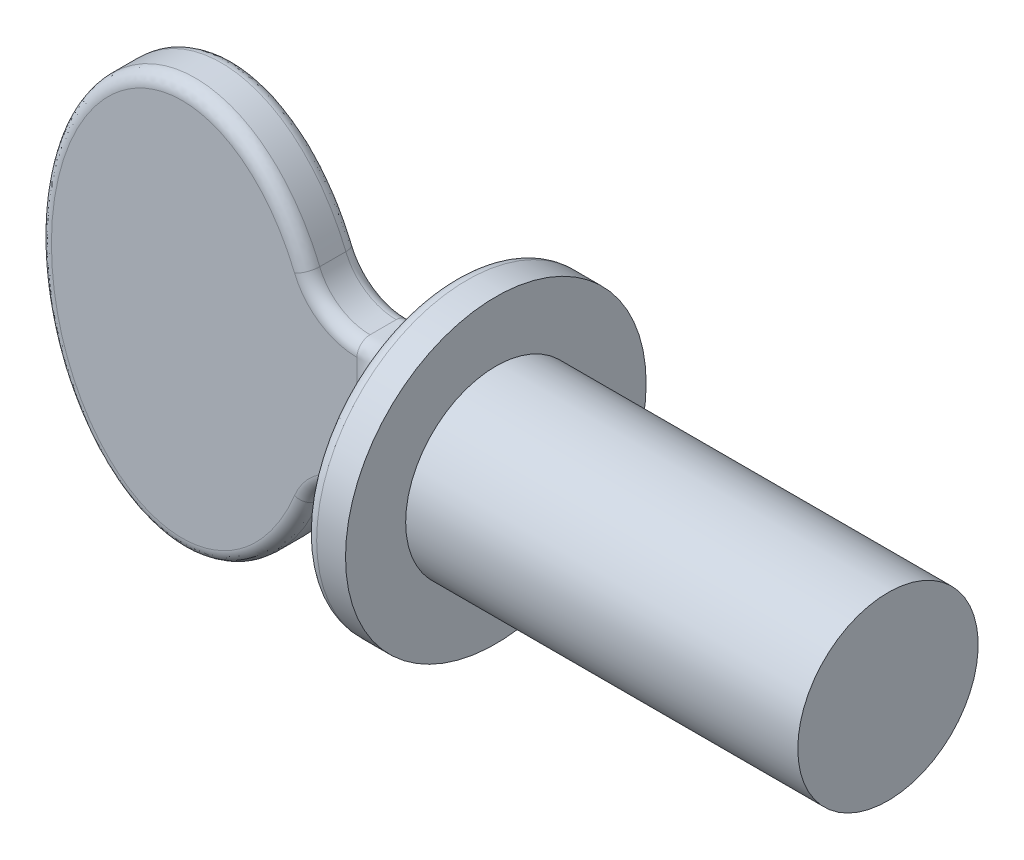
ISO-10303-21;
HEADER;
FILE_DESCRIPTION(('STEP AP214'),'2;1');
FILE_NAME('part.step','',(''),(''),'','','');
FILE_SCHEMA(('AUTOMOTIVE_DESIGN { 1 0 10303 214 1 1 1 1 }'));
ENDSEC;
DATA;
#1=APPLICATION_CONTEXT('core data for automotive mechanical design processes');
#2=APPLICATION_PROTOCOL_DEFINITION('international standard','automotive_design',2000,#1);
#3=PRODUCT_CONTEXT('',#1,'mechanical');
#4=PRODUCT('Part','Part','',(#3));
#5=PRODUCT_RELATED_PRODUCT_CATEGORY('part','',(#4));
#6=PRODUCT_DEFINITION_FORMATION('','',#4);
#7=PRODUCT_DEFINITION_CONTEXT('part definition',#1,'design');
#8=PRODUCT_DEFINITION('design','',#6,#7);
#9=PRODUCT_DEFINITION_SHAPE('','',#8);
#10=(LENGTH_UNIT() NAMED_UNIT(*) SI_UNIT(.MILLI.,.METRE.));
#11=(NAMED_UNIT(*) PLANE_ANGLE_UNIT() SI_UNIT($,.RADIAN.));
#12=(NAMED_UNIT(*) SI_UNIT($,.STERADIAN.) SOLID_ANGLE_UNIT());
#13=UNCERTAINTY_MEASURE_WITH_UNIT(LENGTH_MEASURE(1.E-05),#10,'distance_accuracy_value','');
#14=(GEOMETRIC_REPRESENTATION_CONTEXT(3) GLOBAL_UNCERTAINTY_ASSIGNED_CONTEXT((#13)) GLOBAL_UNIT_ASSIGNED_CONTEXT((#10,
#11,#12)) REPRESENTATION_CONTEXT('',''));
#15=CARTESIAN_POINT('',(0.,0.,0.));
#16=DIRECTION('',(0.,0.,1.));
#17=DIRECTION('',(1.,0.,0.));
#18=AXIS2_PLACEMENT_3D('',#15,#16,#17);
#19=CARTESIAN_POINT('',(3.39763741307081,-2.36920294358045,0.508));
#20=DIRECTION('',(0.,0.,-1.));
#21=DIRECTION('',(-1.,0.,0.));
#22=AXIS2_PLACEMENT_3D('',#19,#20,#21);
#23=CYLINDRICAL_SURFACE('',#22,1.05686961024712);
#24=DIRECTION('',(0.,0.,-1.));
#25=VECTOR('',#24,1.);
#26=CARTESIAN_POINT('',(2.41967497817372,-1.9685,0.508));
#27=LINE('',#26,#25);
#28=CARTESIAN_POINT('',(2.41967497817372,-1.9685,0.254));
#29=VERTEX_POINT('',#28);
#30=CARTESIAN_POINT('',(2.41967497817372,-1.9685,-0.254));
#31=VERTEX_POINT('',#30);
#32=EDGE_CURVE('E434',#29,#31,#27,.T.);
#33=ORIENTED_EDGE('',*,*,#32,.T.);
#34=CARTESIAN_POINT('',(3.39763741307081,-2.36920294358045,-0.254));
#35=DIRECTION('',(0.,0.,1.));
#36=DIRECTION('',(1.,0.,0.));
#37=AXIS2_PLACEMENT_3D('',#34,#35,#36);
#38=CIRCLE('',#37,1.05686961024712);
#39=CARTESIAN_POINT('',(3.39763741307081,-1.31233333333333,-0.254));
#40=VERTEX_POINT('',#39);
#41=EDGE_CURVE('E757',#31,#40,#38,.F.);
#42=ORIENTED_EDGE('',*,*,#41,.T.);
#43=DIRECTION('',(0.,0.,-1.));
#44=VECTOR('',#43,1.);
#45=CARTESIAN_POINT('',(3.39763741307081,-1.31233333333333,0.508));
#46=LINE('',#45,#44);
#47=CARTESIAN_POINT('',(3.39763741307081,-1.31233333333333,0.254));
#48=VERTEX_POINT('',#47);
#49=EDGE_CURVE('E363',#48,#40,#46,.T.);
#50=ORIENTED_EDGE('',*,*,#49,.F.);
#51=CARTESIAN_POINT('',(3.39763741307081,-2.36920294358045,0.254));
#52=DIRECTION('',(0.,0.,1.));
#53=DIRECTION('',(1.,0.,0.));
#54=AXIS2_PLACEMENT_3D('',#51,#52,#53);
#55=CIRCLE('',#54,1.05686961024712);
#56=EDGE_CURVE('E752',#48,#29,#55,.T.);
#57=ORIENTED_EDGE('',*,*,#56,.T.);
#58=EDGE_LOOP('',(#33,#42,#50,#57));
#59=FACE_BOUND('',#58,.T.);
#60=ADVANCED_FACE('F270',(#59),#23,.F.);
#61=CARTESIAN_POINT('',(3.39763741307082,2.36920294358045,0.508));
#62=DIRECTION('',(0.,0.,-1.));
#63=DIRECTION('',(-1.,0.,0.));
#64=AXIS2_PLACEMENT_3D('',#61,#62,#63);
#65=CYLINDRICAL_SURFACE('',#64,1.05686961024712);
#66=DIRECTION('',(0.,0.,-1.));
#67=VECTOR('',#66,1.);
#68=CARTESIAN_POINT('',(3.39763741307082,1.31233333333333,0.508));
#69=LINE('',#68,#67);
#70=CARTESIAN_POINT('',(3.39763741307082,1.31233333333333,0.254));
#71=VERTEX_POINT('',#70);
#72=CARTESIAN_POINT('',(3.39763741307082,1.31233333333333,-0.254));
#73=VERTEX_POINT('',#72);
#74=EDGE_CURVE('E621',#71,#73,#69,.T.);
#75=ORIENTED_EDGE('',*,*,#74,.T.);
#76=CARTESIAN_POINT('',(3.39763741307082,2.36920294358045,-0.254));
#77=DIRECTION('',(0.,0.,1.));
#78=DIRECTION('',(1.,0.,0.));
#79=AXIS2_PLACEMENT_3D('',#76,#77,#78);
#80=CIRCLE('',#79,1.05686961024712);
#81=CARTESIAN_POINT('',(2.41967497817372,1.9685,-0.254));
#82=VERTEX_POINT('',#81);
#83=EDGE_CURVE('E552',#73,#82,#80,.F.);
#84=ORIENTED_EDGE('',*,*,#83,.T.);
#85=DIRECTION('',(0.,0.,-1.));
#86=VECTOR('',#85,1.);
#87=CARTESIAN_POINT('',(2.41967497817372,1.9685,0.508));
#88=LINE('',#87,#86);
#89=CARTESIAN_POINT('',(2.41967497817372,1.9685,0.254));
#90=VERTEX_POINT('',#89);
#91=EDGE_CURVE('E622',#90,#82,#88,.T.);
#92=ORIENTED_EDGE('',*,*,#91,.F.);
#93=CARTESIAN_POINT('',(3.39763741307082,2.36920294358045,0.254));
#94=DIRECTION('',(0.,0.,1.));
#95=DIRECTION('',(1.,0.,0.));
#96=AXIS2_PLACEMENT_3D('',#93,#94,#95);
#97=CIRCLE('',#96,1.05686961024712);
#98=EDGE_CURVE('E544',#90,#71,#97,.T.);
#99=ORIENTED_EDGE('',*,*,#98,.T.);
#100=EDGE_LOOP('',(#75,#84,#92,#99));
#101=FACE_BOUND('',#100,.T.);
#102=ADVANCED_FACE('F438',(#101),#65,.F.);
#103=CARTESIAN_POINT('',(0.,0.,0.508));
#104=DIRECTION('',(0.,0.,1.));
#105=DIRECTION('',(0.,1.,0.));
#106=AXIS2_PLACEMENT_3D('',#103,#104,#105);
#107=ELLIPSE('',#106,3.937,2.794);
#108=DIRECTION('',(0.,0.,-1.));
#109=VECTOR('',#108,1.);
#110=SURFACE_OF_LINEAR_EXTRUSION('',#107,#109);
#111=ORIENTED_EDGE('',*,*,#91,.T.);
#112=CARTESIAN_POINT('',(-2.42953871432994,-1.06988650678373,-0.508));
#113=CARTESIAN_POINT('',(-2.67806308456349,-1.1223425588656,-0.508));
#114=CARTESIAN_POINT('',(-2.67806308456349,-1.1223425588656,-0.254));
#115=CARTESIAN_POINT('',(-2.38132756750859,-1.29830917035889,-0.508));
#116=CARTESIAN_POINT('',(-2.62738331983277,-1.36245895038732,-0.508));
#117=CARTESIAN_POINT('',(-2.62738331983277,-1.36245895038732,-0.254));
#118=CARTESIAN_POINT('',(-2.31706517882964,-1.52335296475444,-0.508));
#119=CARTESIAN_POINT('',(-2.55974244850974,-1.59951584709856,-0.508));
#120=CARTESIAN_POINT('',(-2.55974244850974,-1.59951584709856,-0.254));
#121=CARTESIAN_POINT('',(-2.15402597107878,-1.9606753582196,-0.508));
#122=CARTESIAN_POINT('',(-2.38735395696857,-2.06194694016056,-0.508));
#123=CARTESIAN_POINT('',(-2.38735395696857,-2.06194694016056,-0.254));
#124=CARTESIAN_POINT('',(-2.05530031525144,-2.17297233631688,-0.508));
#125=CARTESIAN_POINT('',(-2.28266133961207,-2.28733788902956,-0.508));
#126=CARTESIAN_POINT('',(-2.28266133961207,-2.28733788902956,-0.254));
#127=CARTESIAN_POINT('',(-1.8565056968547,-2.51319514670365,-0.508));
#128=CARTESIAN_POINT('',(-2.0702557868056,-2.65084271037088,-0.508));
#129=CARTESIAN_POINT('',(-2.0702557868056,-2.65084271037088,-0.254));
#130=CARTESIAN_POINT('',(-1.76631603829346,-2.64689289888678,-0.508));
#131=CARTESIAN_POINT('',(-1.97351333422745,-2.79437306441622,-0.508));
#132=CARTESIAN_POINT('',(-1.97351333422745,-2.79437306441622,-0.254));
#133=CARTESIAN_POINT('',(-1.56670354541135,-2.89917346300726,-0.508));
#134=CARTESIAN_POINT('',(-1.75790917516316,-3.06687436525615,-0.508));
#135=CARTESIAN_POINT('',(-1.75790917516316,-3.06687436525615,-0.254));
#136=CARTESIAN_POINT('',(-1.45730856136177,-3.01777773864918,-0.508));
#137=CARTESIAN_POINT('',(-1.63907948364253,-3.19586595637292,-0.508));
#138=CARTESIAN_POINT('',(-1.63907948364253,-3.19586595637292,-0.254));
#139=CARTESIAN_POINT('',(-1.24726681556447,-3.20759724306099,-0.508));
#140=CARTESIAN_POINT('',(-1.40883959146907,-3.40393298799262,-0.508));
#141=CARTESIAN_POINT('',(-1.40883959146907,-3.40393298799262,-0.254));
#142=CARTESIAN_POINT('',(-1.1507555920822,-3.28336841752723,-0.508));
#143=CARTESIAN_POINT('',(-1.30241841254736,-3.487576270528,-0.508));
#144=CARTESIAN_POINT('',(-1.30241841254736,-3.487576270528,-0.254));
#145=CARTESIAN_POINT('',(-0.946803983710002,-3.41849479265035,-0.508));
#146=CARTESIAN_POINT('',(-1.07576597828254,-3.63774144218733,-0.508));
#147=CARTESIAN_POINT('',(-1.07576597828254,-3.63774144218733,-0.254));
#148=CARTESIAN_POINT('',(-0.839378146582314,-3.47787146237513,-0.508));
#149=CARTESIAN_POINT('',(-0.955553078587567,-3.70428571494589,-0.508));
#150=CARTESIAN_POINT('',(-0.955553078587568,-3.70428571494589,-0.254));
#151=CARTESIAN_POINT('',(-0.633843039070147,-3.56789218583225,-0.508));
#152=CARTESIAN_POINT('',(-0.723818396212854,-3.80577636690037,-0.508));
#153=CARTESIAN_POINT('',(-0.723818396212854,-3.80577636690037,-0.254));
#154=CARTESIAN_POINT('',(-0.537108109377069,-3.60165598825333,-0.508));
#155=CARTESIAN_POINT('',(-0.614119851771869,-3.84411987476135,-0.508));
#156=CARTESIAN_POINT('',(-0.614119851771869,-3.84411987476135,-0.254));
#157=CARTESIAN_POINT('',(-0.339331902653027,-3.65248383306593,-0.508));
#158=CARTESIAN_POINT('',(-0.388801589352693,-3.90202243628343,-0.508));
#159=CARTESIAN_POINT('',(-0.388801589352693,-3.90202243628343,-0.254));
#160=CARTESIAN_POINT('',(-0.238293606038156,-3.66955924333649,-0.508));
#161=CARTESIAN_POINT('',(-0.273185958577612,-3.92159427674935,-0.508));
#162=CARTESIAN_POINT('',(-0.273185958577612,-3.92159427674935,-0.254));
#163=CARTESIAN_POINT('',(-0.0344753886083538,-3.68567445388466,-0.508));
#164=CARTESIAN_POINT('',(-0.0395873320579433,-3.94006182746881,-0.508));
#165=CARTESIAN_POINT('',(-0.0395873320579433,-3.94006182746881,-0.254));
#166=CARTESIAN_POINT('',(0.0683086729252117,-3.68466274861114,-0.508));
#167=CARTESIAN_POINT('',(0.0784014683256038,-3.93889849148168,-0.508));
#168=CARTESIAN_POINT('',(0.0784014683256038,-3.93889849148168,-0.254));
#169=CARTESIAN_POINT('',(0.272088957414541,-3.66456417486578,-0.508));
#170=CARTESIAN_POINT('',(0.311869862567,-3.91587428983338,-0.508));
#171=CARTESIAN_POINT('',(0.311869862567,-3.91587428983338,-0.254));
#172=CARTESIAN_POINT('',(0.373084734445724,-3.64547286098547,-0.508));
#173=CARTESIAN_POINT('',(0.427348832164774,-3.89400833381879,-0.508));
#174=CARTESIAN_POINT('',(0.427348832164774,-3.89400833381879,-0.254));
#175=CARTESIAN_POINT('',(0.566584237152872,-3.5918099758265,-0.508));
#176=CARTESIAN_POINT('',(0.647572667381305,-3.83293861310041,-0.508));
#177=CARTESIAN_POINT('',(0.647572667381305,-3.83293861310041,-0.254));
#178=CARTESIAN_POINT('',(0.659265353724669,-3.5578663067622,-0.508));
#179=CARTESIAN_POINT('',(0.75256001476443,-3.79443882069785,-0.508));
#180=CARTESIAN_POINT('',(0.75256001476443,-3.79443882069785,-0.254));
#181=CARTESIAN_POINT('',(0.838615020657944,-3.47679355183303,-0.508));
#182=CARTESIAN_POINT('',(0.954592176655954,-3.70311336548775,-0.508));
#183=CARTESIAN_POINT('',(0.954592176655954,-3.70311336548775,-0.254));
#184=CARTESIAN_POINT('',(0.925281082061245,-3.42965904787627,-0.508));
#185=CARTESIAN_POINT('',(1.05163370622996,-3.65028181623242,-0.508));
#186=CARTESIAN_POINT('',(1.05163370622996,-3.65028181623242,-0.254));
#187=CARTESIAN_POINT('',(1.12953179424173,-3.30045366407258,-0.508));
#188=CARTESIAN_POINT('',(1.27904250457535,-3.50643406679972,-0.508));
#189=CARTESIAN_POINT('',(1.27904250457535,-3.50643406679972,-0.254));
#190=CARTESIAN_POINT('',(1.24323792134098,-3.21224549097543,-0.508));
#191=CARTESIAN_POINT('',(1.40447787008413,-3.40898221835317,-0.508));
#192=CARTESIAN_POINT('',(1.40447787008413,-3.40898221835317,-0.254));
#193=CARTESIAN_POINT('',(1.45504675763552,-3.01870052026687,-0.508));
#194=CARTESIAN_POINT('',(1.63653892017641,-3.19692872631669,-0.508));
#195=CARTESIAN_POINT('',(1.63653892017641,-3.19692872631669,-0.254));
#196=CARTESIAN_POINT('',(1.55311138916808,-2.91332314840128,-0.508));
#197=CARTESIAN_POINT('',(1.74311876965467,-3.08228651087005,-0.508));
#198=CARTESIAN_POINT('',(1.74311876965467,-3.08228651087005,-0.254));
#199=CARTESIAN_POINT('',(1.75678198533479,-2.66196868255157,-0.508));
#200=CARTESIAN_POINT('',(1.9633248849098,-2.81052824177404,-0.508));
#201=CARTESIAN_POINT('',(1.9633248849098,-2.81052824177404,-0.254));
#202=CARTESIAN_POINT('',(1.85800944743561,-2.51246781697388,-0.508));
#203=CARTESIAN_POINT('',(2.07190130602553,-2.65000792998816,-0.508));
#204=CARTESIAN_POINT('',(2.07190130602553,-2.65000792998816,-0.254));
#205=CARTESIAN_POINT('',(2.03785333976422,-2.20076254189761,-0.508));
#206=CARTESIAN_POINT('',(2.26397611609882,-2.31709468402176,-0.508));
#207=CARTESIAN_POINT('',(2.26397611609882,-2.31709468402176,-0.254));
#208=CARTESIAN_POINT('',(2.11647846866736,-2.03856305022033,-0.508));
#209=CARTESIAN_POINT('',(2.34748415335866,-2.14470634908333,-0.508));
#210=CARTESIAN_POINT('',(2.34748415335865,-2.14470634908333,-0.254));
#211=CARTESIAN_POINT('',(2.22461915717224,-1.7746150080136,-0.508));
#212=CARTESIAN_POINT('',(2.46201925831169,-1.8651443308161,-0.508));
#213=CARTESIAN_POINT('',(2.46201925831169,-1.8651443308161,-0.254));
#214=CARTESIAN_POINT('',(2.2609989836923,-1.67559877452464,-0.508));
#215=CARTESIAN_POINT('',(2.5004698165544,-1.76047506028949,-0.508));
#216=CARTESIAN_POINT('',(2.5004698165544,-1.76047506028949,-0.254));
#217=CARTESIAN_POINT('',(2.32683156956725,-1.47533598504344,-0.508));
#218=CARTESIAN_POINT('',(2.56995291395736,-1.54910644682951,-0.508));
#219=CARTESIAN_POINT('',(2.56995291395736,-1.54910644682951,-0.254));
#220=CARTESIAN_POINT('',(2.35628633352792,-1.37409008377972,-0.508));
#221=CARTESIAN_POINT('',(2.60098759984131,-1.44240770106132,-0.508));
#222=CARTESIAN_POINT('',(2.60098759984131,-1.44240770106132,-0.254));
#223=CARTESIAN_POINT('',(2.45282237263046,-0.99672785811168,-0.508));
#224=CARTESIAN_POINT('',(2.70261039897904,-1.04518135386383,-0.508));
#225=CARTESIAN_POINT('',(2.70261039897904,-1.04518135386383,-0.254));
#226=CARTESIAN_POINT('',(2.49907252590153,-0.715044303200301,-0.508));
#227=CARTESIAN_POINT('',(2.7510952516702,-0.74956565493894,-0.508));
#228=CARTESIAN_POINT('',(2.7510952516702,-0.74956565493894,-0.254));
#229=CARTESIAN_POINT('',(2.54567248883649,-0.147495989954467,-0.508));
#230=CARTESIAN_POINT('',(2.79994937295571,-0.154504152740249,-0.508));
#231=CARTESIAN_POINT('',(2.79994937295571,-0.154504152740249,-0.254));
#232=CARTESIAN_POINT('',(2.54590842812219,0.138377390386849,-0.508));
#233=CARTESIAN_POINT('',(2.80019927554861,0.144949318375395,-0.508));
#234=CARTESIAN_POINT('',(2.80019927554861,0.144949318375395,-0.254));
#235=CARTESIAN_POINT('',(2.50314262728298,0.670744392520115,-0.508));
#236=CARTESIAN_POINT('',(2.75536014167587,0.703113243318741,-0.508));
#237=CARTESIAN_POINT('',(2.75536014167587,0.703113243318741,-0.254));
#238=CARTESIAN_POINT('',(2.46556625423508,0.917675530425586,-0.508));
#239=CARTESIAN_POINT('',(2.71596009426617,0.962218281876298,-0.508));
#240=CARTESIAN_POINT('',(2.71596009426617,0.962218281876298,-0.254));
#241=CARTESIAN_POINT('',(2.35351407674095,1.40317160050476,-0.508));
#242=CARTESIAN_POINT('',(2.5981091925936,1.47286514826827,-0.508));
#243=CARTESIAN_POINT('',(2.5981091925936,1.47286514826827,-0.254));
#244=CARTESIAN_POINT('',(2.27905720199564,1.64174075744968,-0.508));
#245=CARTESIAN_POINT('',(2.51967837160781,1.72441078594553,-0.508));
#246=CARTESIAN_POINT('',(2.51967837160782,1.72441078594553,-0.254));
#247=CARTESIAN_POINT('',(2.10296943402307,2.07153806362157,-0.508));
#248=CARTESIAN_POINT('',(2.33317448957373,2.17963119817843,-0.508));
#249=CARTESIAN_POINT('',(2.33317448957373,2.17963119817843,-0.254));
#250=CARTESIAN_POINT('',(2.00636516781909,2.26480890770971,-0.508));
#251=CARTESIAN_POINT('',(2.23053377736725,2.38518362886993,-0.508));
#252=CARTESIAN_POINT('',(2.23053377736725,2.38518362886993,-0.254));
#253=CARTESIAN_POINT('',(1.78047465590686,2.63124667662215,-0.508));
#254=CARTESIAN_POINT('',(1.98878457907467,2.77737954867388,-0.508));
#255=CARTESIAN_POINT('',(1.98878457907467,2.77737954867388,-0.254));
#256=CARTESIAN_POINT('',(1.65129083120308,2.80447416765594,-0.508));
#257=CARTESIAN_POINT('',(1.84979032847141,2.96407977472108,-0.508));
#258=CARTESIAN_POINT('',(1.84979032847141,2.96407977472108,-0.254));
#259=CARTESIAN_POINT('',(1.41779860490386,3.05444647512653,-0.508));
#260=CARTESIAN_POINT('',(1.59578914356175,3.23598875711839,-0.508));
#261=CARTESIAN_POINT('',(1.59578914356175,3.23598875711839,-0.254));
#262=CARTESIAN_POINT('',(1.32477852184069,3.14175732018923,-0.508));
#263=CARTESIAN_POINT('',(1.49405856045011,3.33156937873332,-0.508));
#264=CARTESIAN_POINT('',(1.49405856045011,3.33156937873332,-0.254));
#265=CARTESIAN_POINT('',(1.1264653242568,3.3011914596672,-0.508));
#266=CARTESIAN_POINT('',(1.27551873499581,3.50726804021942,-0.508));
#267=CARTESIAN_POINT('',(1.27551873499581,3.50726804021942,-0.254));
#268=CARTESIAN_POINT('',(1.02118853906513,3.37333460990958,-0.508));
#269=CARTESIAN_POINT('',(1.15872953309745,3.58740628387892,-0.508));
#270=CARTESIAN_POINT('',(1.15872953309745,3.58740628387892,-0.254));
#271=CARTESIAN_POINT('',(0.817330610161,3.48785914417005,-0.508));
#272=CARTESIAN_POINT('',(0.930720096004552,3.7154934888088,-0.508));
#273=CARTESIAN_POINT('',(0.930720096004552,3.7154934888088,-0.254));
#274=CARTESIAN_POINT('',(0.720402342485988,3.53316262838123,-0.508));
#275=CARTESIAN_POINT('',(0.821632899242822,3.76654812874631,-0.508));
#276=CARTESIAN_POINT('',(0.821632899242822,3.76654812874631,-0.254));
#277=CARTESIAN_POINT('',(0.520328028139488,3.60703504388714,-0.508));
#278=CARTESIAN_POINT('',(0.595089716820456,3.85018992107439,-0.508));
#279=CARTESIAN_POINT('',(0.595089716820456,3.85018992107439,-0.254));
#280=CARTESIAN_POINT('',(0.417186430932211,3.63561579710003,-0.508));
#281=CARTESIAN_POINT('',(0.477639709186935,3.88279011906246,-0.508));
#282=CARTESIAN_POINT('',(0.477639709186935,3.88279011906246,-0.254));
#283=CARTESIAN_POINT('',(0.206818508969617,3.67387815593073,-0.508));
#284=CARTESIAN_POINT('',(0.237206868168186,3.92651558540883,-0.508));
#285=CARTESIAN_POINT('',(0.237206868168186,3.92651558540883,-0.254));
#286=CARTESIAN_POINT('',(0.0995732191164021,3.68345742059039,-0.508));
#287=CARTESIAN_POINT('',(0.114197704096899,3.9375245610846,-0.508));
#288=CARTESIAN_POINT('',(0.114197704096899,3.9375245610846,-0.254));
#289=CARTESIAN_POINT('',(-0.114821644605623,3.68250895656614,-0.508));
#290=CARTESIAN_POINT('',(-0.131686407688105,3.93643687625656,-0.508));
#291=CARTESIAN_POINT('',(-0.131686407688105,3.93643687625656,-0.254));
#292=CARTESIAN_POINT('',(-0.221971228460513,3.67198365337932,-0.508));
#293=CARTESIAN_POINT('',(-0.254561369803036,3.92434300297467,-0.508));
#294=CARTESIAN_POINT('',(-0.254561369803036,3.92434300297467,-0.254));
#295=CARTESIAN_POINT('',(-0.423404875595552,3.6335702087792,-0.508));
#296=CARTESIAN_POINT('',(-0.484708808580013,3.88045959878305,-0.508));
#297=CARTESIAN_POINT('',(-0.484708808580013,3.88045959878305,-0.254));
#298=CARTESIAN_POINT('',(-0.517999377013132,3.60726509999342,-0.508));
#299=CARTESIAN_POINT('',(-0.592410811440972,3.85046695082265,-0.508));
#300=CARTESIAN_POINT('',(-0.592410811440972,3.85046695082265,-0.254));
#301=CARTESIAN_POINT('',(-0.702018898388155,3.54051420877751,-0.508));
#302=CARTESIAN_POINT('',(-0.80085538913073,3.77485728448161,-0.508));
#303=CARTESIAN_POINT('',(-0.800855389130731,3.77485728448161,-0.254));
#304=CARTESIAN_POINT('',(-0.791441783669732,3.5000626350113,-0.508));
#305=CARTESIAN_POINT('',(-0.901595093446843,3.72923386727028,-0.508));
#306=CARTESIAN_POINT('',(-0.901595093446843,3.72923386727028,-0.254));
#307=CARTESIAN_POINT('',(-0.995772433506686,3.38993421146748,-0.508));
#308=CARTESIAN_POINT('',(-1.13047031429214,3.60588286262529,-0.508));
#309=CARTESIAN_POINT('',(-1.13047031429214,3.60588286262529,-0.254));
#310=CARTESIAN_POINT('',(-1.10783636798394,3.31498239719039,-0.508));
#311=CARTESIAN_POINT('',(-1.25491481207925,3.52252387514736,-0.508));
#312=CARTESIAN_POINT('',(-1.25491481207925,3.52252387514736,-0.254));
#313=CARTESIAN_POINT('',(-1.31837395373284,3.14796333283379,-0.508));
#314=CARTESIAN_POINT('',(-1.48706802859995,3.33835616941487,-0.508));
#315=CARTESIAN_POINT('',(-1.48706802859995,3.33835616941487,-0.254));
#316=CARTESIAN_POINT('',(-1.41681992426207,3.05586208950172,-0.508));
#317=CARTESIAN_POINT('',(-1.59474271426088,3.23751282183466,-0.508));
#318=CARTESIAN_POINT('',(-1.59474271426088,3.23751282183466,-0.254));
#319=CARTESIAN_POINT('',(-1.63609804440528,2.82020806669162,-0.508));
#320=CARTESIAN_POINT('',(-1.83323646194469,2.98121697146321,-0.508));
#321=CARTESIAN_POINT('',(-1.83323646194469,2.98121697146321,-0.254));
#322=CARTESIAN_POINT('',(-1.75048386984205,2.67067473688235,-0.508));
#323=CARTESIAN_POINT('',(-1.95647717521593,2.81989583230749,-0.508));
#324=CARTESIAN_POINT('',(-1.95647717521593,2.81989583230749,-0.254));
#325=CARTESIAN_POINT('',(-1.95420988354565,2.35553788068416,-0.508));
#326=CARTESIAN_POINT('',(-2.1748556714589,2.48207587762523,-0.508));
#327=CARTESIAN_POINT('',(-2.1748556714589,2.48207587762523,-0.254));
#328=CARTESIAN_POINT('',(-2.04350621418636,2.18990688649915,-0.508));
#329=CARTESIAN_POINT('',(-2.2699442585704,2.30555118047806,-0.508));
#330=CARTESIAN_POINT('',(-2.2699442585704,2.30555118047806,-0.254));
#331=CARTESIAN_POINT('',(-2.22882804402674,1.78241164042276,-0.508));
#332=CARTESIAN_POINT('',(-2.46665332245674,1.87302961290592,-0.508));
#333=CARTESIAN_POINT('',(-2.46665332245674,1.87302961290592,-0.254));
#334=CARTESIAN_POINT('',(-2.3142397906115,1.53572223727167,-0.508));
#335=CARTESIAN_POINT('',(-2.55672789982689,1.61257271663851,-0.508));
#336=CARTESIAN_POINT('',(-2.55672789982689,1.61257271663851,-0.254));
#337=CARTESIAN_POINT('',(-2.44446639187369,1.03199799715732,-0.508));
#338=CARTESIAN_POINT('',(-2.69381177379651,1.08228449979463,-0.508));
#339=CARTESIAN_POINT('',(-2.69381177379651,1.08228449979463,-0.254));
#340=CARTESIAN_POINT('',(-2.48924065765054,0.774953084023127,-0.508));
#341=CARTESIAN_POINT('',(-2.74077801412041,0.812444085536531,-0.508));
#342=CARTESIAN_POINT('',(-2.74077801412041,0.812444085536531,-0.254));
#343=CARTESIAN_POINT('',(-2.54075598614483,0.251563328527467,-0.508));
#344=CARTESIAN_POINT('',(-2.79480168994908,0.263568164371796,-0.508));
#345=CARTESIAN_POINT('',(-2.79480168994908,0.263568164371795,-0.254));
#346=CARTESIAN_POINT('',(-2.54666205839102,-0.0148627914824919,-0.508));
#347=CARTESIAN_POINT('',(-2.80098296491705,-0.015540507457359,-0.508));
#348=CARTESIAN_POINT('',(-2.80098296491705,-0.0155405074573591,-0.254));
#349=CARTESIAN_POINT('',(-2.51848120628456,-0.545613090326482,-0.508));
#350=CARTESIAN_POINT('',(-2.77144588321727,-0.571867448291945,-0.508));
#351=CARTESIAN_POINT('',(-2.77144588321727,-0.571867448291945,-0.254));
#352=CARTESIAN_POINT('',(-2.48440379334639,-0.809937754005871,-0.508));
#353=CARTESIAN_POINT('',(-2.73573749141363,-0.849086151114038,-0.508));
#354=CARTESIAN_POINT('',(-2.73573749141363,-0.849086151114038,-0.254));
#355=CARTESIAN_POINT('',(-2.42953871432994,-1.06988650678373,-0.508));
#356=CARTESIAN_POINT('',(-2.67806308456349,-1.1223425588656,-0.508));
#357=CARTESIAN_POINT('',(-2.67806308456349,-1.1223425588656,-0.254));
#358=(BOUNDED_SURFACE() B_SPLINE_SURFACE(3,2,((#112,#113,#114),(#115,#116,#117),(#118,#119,
#120),(#121,#122,#123),(#124,#125,#126),(#127,#128,#129),(#130,#131,#132),(#133,#134,#135),
(#136,#137,#138),(#139,#140,#141),(#142,#143,#144),(#145,#146,#147),(#148,#149,#150),(#151,#152,
#153),(#154,#155,#156),(#157,#158,#159),(#160,#161,#162),(#163,#164,#165),(#166,#167,#168),
(#169,#170,#171),(#172,#173,#174),(#175,#176,#177),(#178,#179,#180),(#181,#182,#183),(#184,#185,
#186),(#187,#188,#189),(#190,#191,#192),(#193,#194,#195),(#196,#197,#198),(#199,#200,#201),
(#202,#203,#204),(#205,#206,#207),(#208,#209,#210),(#211,#212,#213),(#214,#215,#216),(#217,#218,
#219),(#220,#221,#222),(#223,#224,#225),(#226,#227,#228),(#229,#230,#231),(#232,#233,#234),
(#235,#236,#237),(#238,#239,#240),(#241,#242,#243),(#244,#245,#246),(#247,#248,#249),(#250,#251,
#252),(#253,#254,#255),(#256,#257,#258),(#259,#260,#261),(#262,#263,#264),(#265,#266,#267),
(#268,#269,#270),(#271,#272,#273),(#274,#275,#276),(#277,#278,#279),(#280,#281,#282),(#283,#284,
#285),(#286,#287,#288),(#289,#290,#291),(#292,#293,#294),(#295,#296,#297),(#298,#299,#300),
(#301,#302,#303),(#304,#305,#306),(#307,#308,#309),(#310,#311,#312),(#313,#314,#315),(#316,#317,
#318),(#319,#320,#321),(#322,#323,#324),(#325,#326,#327),(#328,#329,#330),(#331,#332,#333),
(#334,#335,#336),(#337,#338,#339),(#340,#341,#342),(#343,#344,#345),(#346,#347,#348),(#349,#350,
#351),(#352,#353,#354),(#355,#356,#357)),.UNSPECIFIED.,.T.,.F.,
.F.) B_SPLINE_SURFACE_WITH_KNOTS((4,2,2,2,2,2,2,2,2,2,2,2,2,2,2,2,2,2,2,2,2,2,2,2,2,2,2,2,2,2,2,
2,2,2,2,2,2,2,2,2,4),(3,3),(0.,0.699735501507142,1.39843658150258,1.88081590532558,
2.36250140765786,2.7293120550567,3.09564005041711,3.401707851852,3.7075670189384,
4.01429730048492,4.32110302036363,4.61603131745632,4.91108093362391,5.34040544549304,
5.77075965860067,6.31008999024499,6.84921247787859,7.16544039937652,7.48157666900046,
8.33348152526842,9.18749454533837,9.93427445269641,10.6806714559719,11.3262865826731,
11.9698968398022,12.3514499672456,12.7325004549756,13.052173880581,13.371621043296,
13.6927841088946,14.0139084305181,14.3072154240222,14.6006426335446,15.0028628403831,
15.405888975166,15.9675913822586,16.530269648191,17.3092934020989,18.0890943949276,
18.8855943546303,19.6819048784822),(0.,1.),
.UNSPECIFIED.) GEOMETRIC_REPRESENTATION_ITEM() RATIONAL_B_SPLINE_SURFACE(((1.,0.707106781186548,
1.),(1.,0.707106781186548,1.),(1.,0.707106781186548,1.),(1.,0.707106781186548,1.),(1.,
0.707106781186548,1.),(1.,0.707106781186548,1.),(1.,0.707106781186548,1.),(1.,0.707106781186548,
1.),(1.,0.707106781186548,1.),(1.,0.707106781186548,1.),(1.,0.707106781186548,1.),(1.,
0.707106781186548,1.),(1.,0.707106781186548,1.),(1.,0.707106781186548,1.),(1.,0.707106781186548,
1.),(1.,0.707106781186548,1.),(1.,0.707106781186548,1.),(1.,0.707106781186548,1.),(1.,
0.707106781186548,1.),(1.,0.707106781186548,1.),(1.,0.707106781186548,1.),(1.,0.707106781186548,
1.),(1.,0.707106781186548,1.),(1.,0.707106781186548,1.),(1.,0.707106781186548,1.),(1.,
0.707106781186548,1.),(1.,0.707106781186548,1.),(1.,0.707106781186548,1.),(1.,0.707106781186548,
1.),(1.,0.707106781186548,1.),(1.,0.707106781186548,1.),(1.,0.707106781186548,1.),(1.,
0.707106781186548,1.),(1.,0.707106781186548,1.),(1.,0.707106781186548,1.),(1.,0.707106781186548,
1.),(1.,0.707106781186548,1.),(1.,0.707106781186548,1.),(1.,0.707106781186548,1.),(1.,
0.707106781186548,1.),(1.,0.707106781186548,1.),(1.,0.707106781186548,1.),(1.,0.707106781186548,
1.),(1.,0.707106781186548,1.),(1.,0.707106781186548,1.),(1.,0.707106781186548,1.),(1.,
0.707106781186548,1.),(1.,0.707106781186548,1.),(1.,0.707106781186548,1.),(1.,0.707106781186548,
1.),(1.,0.707106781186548,1.),(1.,0.707106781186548,1.),(1.,0.707106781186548,1.),(1.,
0.707106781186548,1.),(1.,0.707106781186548,1.),(1.,0.707106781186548,1.),(1.,0.707106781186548,
1.),(1.,0.707106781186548,1.),(1.,0.707106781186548,1.),(1.,0.707106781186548,1.),(1.,
0.707106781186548,1.),(1.,0.707106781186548,1.),(1.,0.707106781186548,1.),(1.,0.707106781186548,
1.),(1.,0.707106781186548,1.),(1.,0.707106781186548,1.),(1.,0.707106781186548,1.),(1.,
0.707106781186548,1.),(1.,0.707106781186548,1.),(1.,0.707106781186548,1.),(1.,0.707106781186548,
1.),(1.,0.707106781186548,1.),(1.,0.707106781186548,1.),(1.,0.707106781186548,1.),(1.,
0.707106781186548,1.),(1.,0.707106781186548,1.),(1.,0.707106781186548,1.),(1.,0.707106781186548,
1.),(1.,0.707106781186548,1.),(1.,0.707106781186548,1.),(1.,0.707106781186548,1.),(1.,
0.707106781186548,1.))) REPRESENTATION_ITEM('') SURFACE());
#359=CARTESIAN_POINT('',(2.41967497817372,1.9685,-0.254));
#360=CARTESIAN_POINT('',(2.25031042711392,2.38542945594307,-0.254));
#361=CARTESIAN_POINT('',(2.00596675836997,2.79648158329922,-0.254));
#362=CARTESIAN_POINT('',(1.49799160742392,3.34093166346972,-0.254));
#363=CARTESIAN_POINT('',(1.27918524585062,3.52006526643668,-0.254));
#364=CARTESIAN_POINT('',(0.824519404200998,3.77487228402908,-0.254));
#365=CARTESIAN_POINT('',(0.5953372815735,3.86152000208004,-0.254));
#366=CARTESIAN_POINT('',(0.11627433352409,3.94837182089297,-0.254));
#367=CARTESIAN_POINT('',(-0.133883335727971,3.94714153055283,-0.254));
#368=CARTESIAN_POINT('',(-0.592713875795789,3.86005719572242,-0.254));
#369=CARTESIAN_POINT('',(-0.803064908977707,3.78232434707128,-0.254));
#370=CARTESIAN_POINT('',(-1.25884339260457,3.53671269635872,-0.254));
#371=CARTESIAN_POINT('',(-1.49225794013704,3.34730250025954,-0.254));
#372=CARTESIAN_POINT('',(-1.9688886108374,2.83590773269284,-0.254));
#373=CARTESIAN_POINT('',(-2.18567037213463,2.49073765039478,-0.254));
#374=CARTESIAN_POINT('',(-2.57946081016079,1.62514496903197,-0.254));
#375=CARTESIAN_POINT('',(-2.71380281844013,1.08646076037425,-0.254));
#376=CARTESIAN_POINT('',(-2.82215303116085,-0.0142692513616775,-0.254));
#377=CARTESIAN_POINT('',(-2.79328752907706,-0.576559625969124,-0.254));
#378=CARTESIAN_POINT('',(-2.5760189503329,-1.60569439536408,-0.254));
#379=CARTESIAN_POINT('',(-2.40624277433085,-2.07609930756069,-0.254));
#380=CARTESIAN_POINT('',(-1.98146625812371,-2.80261486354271,-0.254));
#381=CARTESIAN_POINT('',(-1.76650882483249,-3.08096180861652,-0.254));
#382=CARTESIAN_POINT('',(-1.30657381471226,-3.49615219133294,-0.254));
#383=CARTESIAN_POINT('',(-1.07838575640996,-3.65062001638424,-0.254));
#384=CARTESIAN_POINT('',(-0.616409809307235,-3.85270583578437,-0.254));
#385=CARTESIAN_POINT('',(-0.388253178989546,-3.91258803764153,-0.254));
#386=CARTESIAN_POINT('',(0.0769150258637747,-3.94918083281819,-0.254));
#387=CARTESIAN_POINT('',(0.313980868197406,-3.92525354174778,-0.254));
#388=CARTESIAN_POINT('',(0.753403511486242,-3.80377336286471,-0.254));
#389=CARTESIAN_POINT('',(0.956930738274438,-3.71016433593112,-0.254));
#390=CARTESIAN_POINT('',(1.40977740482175,-3.42376866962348,-0.254));
#391=CARTESIAN_POINT('',(1.6427552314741,-3.20589476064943,-0.254));
#392=CARTESIAN_POINT('',(2.03111441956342,-2.72710992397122,-0.254));
#393=CARTESIAN_POINT('',(2.18919790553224,-2.46823947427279,-0.254));
#394=CARTESIAN_POINT('',(2.35453247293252,-2.12142025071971,-0.254));
#395=CARTESIAN_POINT('',(2.38815642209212,-2.04532960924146,-0.254));
#396=CARTESIAN_POINT('',(2.41967497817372,-1.9685,-0.254));
#397=B_SPLINE_CURVE_WITH_KNOTS('',3,(#359,#360,#361,#362,#363,#364,#365,#366,#367,#368,#369,
#370,#371,#372,#373,#374,#375,#376,#377,#378,#379,#380,#381,#382,#383,#384,#385,#386,#387,#388,
#389,#390,#391,#392,#393,#394,#395,#396),.UNSPECIFIED.,.F.,.F.,(4,2,2,2,2,2,2,2,2,2,2,2,2,2,2,2,
2,2,4),(0.,1.37556453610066,2.21375379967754,2.93458248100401,3.66717955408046,4.32956836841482,
5.21483606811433,6.41718702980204,8.05393798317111,9.71959706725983,11.1947245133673,
12.2336794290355,13.0458946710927,13.740094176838,14.4395887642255,15.1022444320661,
16.0414723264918,16.9435917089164,17.1929672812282),.UNSPECIFIED.);
#398=EDGE_CURVE('E476',#82,#31,#397,.T.);
#399=ORIENTED_EDGE('',*,*,#398,.T.);
#400=ORIENTED_EDGE('',*,*,#32,.F.);
#401=CARTESIAN_POINT('',(-2.42953871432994,1.06988650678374,0.508));
#402=CARTESIAN_POINT('',(-2.67806308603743,1.12234255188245,0.508));
#403=CARTESIAN_POINT('',(-2.67806308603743,1.12234255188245,0.254));
#404=CARTESIAN_POINT('',(-2.38132756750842,1.29830917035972,0.508));
#405=CARTESIAN_POINT('',(-2.62738332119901,1.36245894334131,0.508));
#406=CARTESIAN_POINT('',(-2.62738332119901,1.36245894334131,0.254));
#407=CARTESIAN_POINT('',(-2.31706517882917,1.52335296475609,0.508));
#408=CARTESIAN_POINT('',(-2.55974244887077,1.59951584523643,0.508));
#409=CARTESIAN_POINT('',(-2.55974244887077,1.59951584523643,0.254));
#410=CARTESIAN_POINT('',(-2.15402597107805,1.96067535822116,0.508));
#411=CARTESIAN_POINT('',(-2.38735395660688,2.06194694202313,0.508));
#412=CARTESIAN_POINT('',(-2.38735395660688,2.06194694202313,0.254));
#413=CARTESIAN_POINT('',(-2.05530031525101,2.17297233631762,0.508));
#414=CARTESIAN_POINT('',(-2.28266133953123,2.28733788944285,0.508));
#415=CARTESIAN_POINT('',(-2.28266133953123,2.28733788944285,0.254));
#416=CARTESIAN_POINT('',(-1.8565056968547,2.51319514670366,0.508));
#417=CARTESIAN_POINT('',(-2.07025578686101,2.65084271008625,0.508));
#418=CARTESIAN_POINT('',(-2.07025578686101,2.65084271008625,0.254));
#419=CARTESIAN_POINT('',(-1.76631603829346,2.64689289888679,0.508));
#420=CARTESIAN_POINT('',(-1.97351333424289,2.79437306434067,0.508));
#421=CARTESIAN_POINT('',(-1.97351333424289,2.79437306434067,0.254));
#422=CARTESIAN_POINT('',(-1.56670354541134,2.89917346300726,0.508));
#423=CARTESIAN_POINT('',(-1.75790917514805,3.06687436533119,0.508));
#424=CARTESIAN_POINT('',(-1.75790917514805,3.06687436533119,0.254));
#425=CARTESIAN_POINT('',(-1.45730856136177,3.01777773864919,0.508));
#426=CARTESIAN_POINT('',(-1.63907948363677,3.19586595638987,0.508));
#427=CARTESIAN_POINT('',(-1.63907948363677,3.19586595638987,0.254));
#428=CARTESIAN_POINT('',(-1.24726681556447,3.20759724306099,0.508));
#429=CARTESIAN_POINT('',(-1.40883959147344,3.40393298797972,0.508));
#430=CARTESIAN_POINT('',(-1.40883959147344,3.40393298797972,0.254));
#431=CARTESIAN_POINT('',(-1.1507555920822,3.28336841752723,0.508));
#432=CARTESIAN_POINT('',(-1.30241841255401,3.48757627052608,0.508));
#433=CARTESIAN_POINT('',(-1.30241841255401,3.48757627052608,0.254));
#434=CARTESIAN_POINT('',(-0.946803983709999,3.41849479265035,0.508));
#435=CARTESIAN_POINT('',(-1.07576597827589,3.63774144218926,0.508));
#436=CARTESIAN_POINT('',(-1.07576597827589,3.63774144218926,0.254));
#437=CARTESIAN_POINT('',(-0.839378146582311,3.47787146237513,0.508));
#438=CARTESIAN_POINT('',(-0.955553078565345,3.70428571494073,0.508));
#439=CARTESIAN_POINT('',(-0.955553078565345,3.70428571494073,0.254));
#440=CARTESIAN_POINT('',(-0.633843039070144,3.56789218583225,0.508));
#441=CARTESIAN_POINT('',(-0.723818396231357,3.80577636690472,0.508));
#442=CARTESIAN_POINT('',(-0.723818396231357,3.80577636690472,0.254));
#443=CARTESIAN_POINT('',(-0.537108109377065,3.60165598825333,0.508));
#444=CARTESIAN_POINT('',(-0.614119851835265,3.84411987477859,0.508));
#445=CARTESIAN_POINT('',(-0.614119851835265,3.84411987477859,0.254));
#446=CARTESIAN_POINT('',(-0.339331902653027,3.65248383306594,0.508));
#447=CARTESIAN_POINT('',(-0.388801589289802,3.90202243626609,0.508));
#448=CARTESIAN_POINT('',(-0.388801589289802,3.90202243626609,0.254));
#449=CARTESIAN_POINT('',(-0.238293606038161,3.6695592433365,0.508));
#450=CARTESIAN_POINT('',(-0.273185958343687,3.92159427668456,0.508));
#451=CARTESIAN_POINT('',(-0.273185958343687,3.92159427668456,0.254));
#452=CARTESIAN_POINT('',(-0.0344753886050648,3.68567445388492,0.508));
#453=CARTESIAN_POINT('',(-0.0395873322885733,3.94006182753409,0.508));
#454=CARTESIAN_POINT('',(-0.0395873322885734,3.94006182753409,0.254));
#455=CARTESIAN_POINT('',(0.0683086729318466,3.68466274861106,0.508));
#456=CARTESIAN_POINT('',(0.0784014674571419,3.93889849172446,0.508));
#457=CARTESIAN_POINT('',(0.0784014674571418,3.93889849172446,0.254));
#458=CARTESIAN_POINT('',(0.272088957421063,3.66456417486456,0.508));
#459=CARTESIAN_POINT('',(0.311869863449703,3.91587428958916,0.508));
#460=CARTESIAN_POINT('',(0.311869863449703,3.91587428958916,0.254));
#461=CARTESIAN_POINT('',(0.373084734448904,3.64547286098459,0.508));
#462=CARTESIAN_POINT('',(0.427348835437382,3.89400833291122,0.508));
#463=CARTESIAN_POINT('',(0.427348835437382,3.89400833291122,0.254));
#464=CARTESIAN_POINT('',(0.566584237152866,3.5918099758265,0.508));
#465=CARTESIAN_POINT('',(0.647572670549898,3.83293861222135,0.508));
#466=CARTESIAN_POINT('',(0.647572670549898,3.83293861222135,0.254));
#467=CARTESIAN_POINT('',(0.659265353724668,3.5578663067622,0.508));
#468=CARTESIAN_POINT('',(0.752560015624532,3.79443882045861,0.508));
#469=CARTESIAN_POINT('',(0.752560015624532,3.79443882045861,0.254));
#470=CARTESIAN_POINT('',(0.838615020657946,3.47679355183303,0.508));
#471=CARTESIAN_POINT('',(0.954592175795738,3.70311336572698,0.508));
#472=CARTESIAN_POINT('',(0.954592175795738,3.70311336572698,0.254));
#473=CARTESIAN_POINT('',(0.925281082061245,3.42965904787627,0.508));
#474=CARTESIAN_POINT('',(1.05163370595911,3.65028181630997,0.508));
#475=CARTESIAN_POINT('',(1.05163370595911,3.65028181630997,0.254));
#476=CARTESIAN_POINT('',(1.12953179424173,3.30045366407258,0.508));
#477=CARTESIAN_POINT('',(1.2790425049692,3.50643406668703,0.508));
#478=CARTESIAN_POINT('',(1.2790425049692,3.50643406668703,0.254));
#479=CARTESIAN_POINT('',(1.24323792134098,3.21224549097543,0.508));
#480=CARTESIAN_POINT('',(1.40447787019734,3.40898221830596,0.508));
#481=CARTESIAN_POINT('',(1.40447787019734,3.40898221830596,0.254));
#482=CARTESIAN_POINT('',(1.45504675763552,3.01870052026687,0.508));
#483=CARTESIAN_POINT('',(1.63653892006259,3.19692872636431,0.508));
#484=CARTESIAN_POINT('',(1.63653892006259,3.19692872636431,0.254));
#485=CARTESIAN_POINT('',(1.55311138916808,2.91332314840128,0.508));
#486=CARTESIAN_POINT('',(1.74311876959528,3.08228651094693,0.508));
#487=CARTESIAN_POINT('',(1.74311876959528,3.08228651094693,0.254));
#488=CARTESIAN_POINT('',(1.75678198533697,2.66196868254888,0.508));
#489=CARTESIAN_POINT('',(1.96332488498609,2.8105282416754,0.508));
#490=CARTESIAN_POINT('',(1.96332488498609,2.8105282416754,0.254));
#491=CARTESIAN_POINT('',(1.85800944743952,2.51246781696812,0.508));
#492=CARTESIAN_POINT('',(2.07190130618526,2.65000792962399,0.508));
#493=CARTESIAN_POINT('',(2.07190130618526,2.65000792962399,0.254));
#494=CARTESIAN_POINT('',(2.03785333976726,2.20076254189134,0.508));
#495=CARTESIAN_POINT('',(2.26397611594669,2.31709468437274,0.508));
#496=CARTESIAN_POINT('',(2.26397611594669,2.31709468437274,0.254));
#497=CARTESIAN_POINT('',(2.11647846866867,2.03856305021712,0.508));
#498=CARTESIAN_POINT('',(2.34748415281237,2.14470635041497,0.508));
#499=CARTESIAN_POINT('',(2.34748415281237,2.14470635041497,0.254));
#500=CARTESIAN_POINT('',(2.22461915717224,1.7746150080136,0.508));
#501=CARTESIAN_POINT('',(2.4620192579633,1.86514433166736,0.508));
#502=CARTESIAN_POINT('',(2.4620192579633,1.86514433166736,0.254));
#503=CARTESIAN_POINT('',(2.2609989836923,1.67559877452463,0.508));
#504=CARTESIAN_POINT('',(2.50046981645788,1.7604750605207,0.508));
#505=CARTESIAN_POINT('',(2.50046981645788,1.7604750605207,0.254));
#506=CARTESIAN_POINT('',(2.32683156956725,1.47533598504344,0.508));
#507=CARTESIAN_POINT('',(2.56995291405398,1.54910644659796,0.508));
#508=CARTESIAN_POINT('',(2.56995291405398,1.54910644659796,0.254));
#509=CARTESIAN_POINT('',(2.35628633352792,1.37409008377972,0.508));
#510=CARTESIAN_POINT('',(2.6009875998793,1.44240770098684,0.508));
#511=CARTESIAN_POINT('',(2.6009875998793,1.44240770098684,0.254));
#512=CARTESIAN_POINT('',(2.45282237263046,0.996727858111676,0.508));
#513=CARTESIAN_POINT('',(2.7026103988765,1.04518135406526,0.508));
#514=CARTESIAN_POINT('',(2.7026103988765,1.04518135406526,0.254));
#515=CARTESIAN_POINT('',(2.49907252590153,0.715044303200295,0.508));
#516=CARTESIAN_POINT('',(2.75109525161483,0.749565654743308,0.508));
#517=CARTESIAN_POINT('',(2.75109525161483,0.749565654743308,0.254));
#518=CARTESIAN_POINT('',(2.54567248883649,0.147495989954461,0.508));
#519=CARTESIAN_POINT('',(2.79994937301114,0.154504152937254,0.508));
#520=CARTESIAN_POINT('',(2.79994937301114,0.154504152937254,0.254));
#521=CARTESIAN_POINT('',(2.54590842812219,-0.138377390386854,0.508));
#522=CARTESIAN_POINT('',(2.80019927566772,-0.144949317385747,0.508));
#523=CARTESIAN_POINT('',(2.80019927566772,-0.144949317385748,0.254));
#524=CARTESIAN_POINT('',(2.50314262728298,-0.67074439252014,0.508));
#525=CARTESIAN_POINT('',(2.75536014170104,-0.703113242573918,0.508));
#526=CARTESIAN_POINT('',(2.75536014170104,-0.703113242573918,0.254));
#527=CARTESIAN_POINT('',(2.46556625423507,-0.917675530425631,0.508));
#528=CARTESIAN_POINT('',(2.71596009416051,-0.962218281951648,0.508));
#529=CARTESIAN_POINT('',(2.7159600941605,-0.962218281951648,0.254));
#530=CARTESIAN_POINT('',(2.35351407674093,-1.4031716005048,0.508));
#531=CARTESIAN_POINT('',(2.59810919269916,-1.47286514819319,0.508));
#532=CARTESIAN_POINT('',(2.59810919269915,-1.47286514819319,0.254));
#533=CARTESIAN_POINT('',(2.27905720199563,-1.6417407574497,0.508));
#534=CARTESIAN_POINT('',(2.51967837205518,-1.72441078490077,0.508));
#535=CARTESIAN_POINT('',(2.51967837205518,-1.72441078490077,0.254));
#536=CARTESIAN_POINT('',(2.10296943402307,-2.07153806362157,0.508));
#537=CARTESIAN_POINT('',(2.33317448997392,-2.17963119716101,0.508));
#538=CARTESIAN_POINT('',(2.33317448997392,-2.17963119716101,0.254));
#539=CARTESIAN_POINT('',(2.00636516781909,-2.26480890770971,0.508));
#540=CARTESIAN_POINT('',(2.2305337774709,-2.38518362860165,0.508));
#541=CARTESIAN_POINT('',(2.2305337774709,-2.38518362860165,0.254));
#542=CARTESIAN_POINT('',(1.78047465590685,-2.63124667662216,0.508));
#543=CARTESIAN_POINT('',(1.98878457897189,-2.77737954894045,0.508));
#544=CARTESIAN_POINT('',(1.98878457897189,-2.77737954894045,0.254));
#545=CARTESIAN_POINT('',(1.65129083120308,-2.80447416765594,0.508));
#546=CARTESIAN_POINT('',(1.84979032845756,-2.96407977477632,0.508));
#547=CARTESIAN_POINT('',(1.84979032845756,-2.96407977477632,0.254));
#548=CARTESIAN_POINT('',(1.41779860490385,-3.05444647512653,0.508));
#549=CARTESIAN_POINT('',(1.59578914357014,-3.23598875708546,0.508));
#550=CARTESIAN_POINT('',(1.59578914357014,-3.23598875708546,0.254));
#551=CARTESIAN_POINT('',(1.32477852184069,-3.14175732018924,0.508));
#552=CARTESIAN_POINT('',(1.49405856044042,-3.33156937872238,0.508));
#553=CARTESIAN_POINT('',(1.49405856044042,-3.33156937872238,0.254));
#554=CARTESIAN_POINT('',(1.1264653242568,-3.30119145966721,0.508));
#555=CARTESIAN_POINT('',(1.27551873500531,-3.50726804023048,0.508));
#556=CARTESIAN_POINT('',(1.27551873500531,-3.50726804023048,0.254));
#557=CARTESIAN_POINT('',(1.02118853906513,-3.37333460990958,0.508));
#558=CARTESIAN_POINT('',(1.15872953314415,-3.58740628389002,0.508));
#559=CARTESIAN_POINT('',(1.15872953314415,-3.58740628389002,0.254));
#560=CARTESIAN_POINT('',(0.817330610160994,-3.48785914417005,0.508));
#561=CARTESIAN_POINT('',(0.930720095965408,-3.71549348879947,0.508));
#562=CARTESIAN_POINT('',(0.930720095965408,-3.71549348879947,0.254));
#563=CARTESIAN_POINT('',(0.720402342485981,-3.53316262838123,0.508));
#564=CARTESIAN_POINT('',(0.821632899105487,-3.76654812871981,0.508));
#565=CARTESIAN_POINT('',(0.821632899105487,-3.76654812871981,0.254));
#566=CARTESIAN_POINT('',(0.520328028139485,-3.60703504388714,0.508));
#567=CARTESIAN_POINT('',(0.595089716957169,-3.85018992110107,0.508));
#568=CARTESIAN_POINT('',(0.595089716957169,-3.85018992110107,0.254));
#569=CARTESIAN_POINT('',(0.417186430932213,-3.63561579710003,0.508));
#570=CARTESIAN_POINT('',(0.477639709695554,-3.88279011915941,0.508));
#571=CARTESIAN_POINT('',(0.477639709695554,-3.88279011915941,0.254));
#572=CARTESIAN_POINT('',(0.206818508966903,-3.67387815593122,0.508));
#573=CARTESIAN_POINT('',(0.237206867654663,-3.92651558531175,0.508));
#574=CARTESIAN_POINT('',(0.237206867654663,-3.92651558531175,0.254));
#575=CARTESIAN_POINT('',(0.0995732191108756,-3.68345742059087,0.508));
#576=CARTESIAN_POINT('',(0.114197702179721,-3.93752456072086,0.508));
#577=CARTESIAN_POINT('',(0.114197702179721,-3.93752456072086,0.254));
#578=CARTESIAN_POINT('',(-0.114821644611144,-3.68250895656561,0.508));
#579=CARTESIAN_POINT('',(-0.131686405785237,-3.93643687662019,0.508));
#580=CARTESIAN_POINT('',(-0.131686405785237,-3.93643687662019,0.254));
#581=CARTESIAN_POINT('',(-0.221971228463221,-3.67198365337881,0.508));
#582=CARTESIAN_POINT('',(-0.254561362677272,-3.92434300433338,0.508));
#583=CARTESIAN_POINT('',(-0.254561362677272,-3.92434300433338,0.254));
#584=CARTESIAN_POINT('',(-0.423404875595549,-3.6335702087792,0.508));
#585=CARTESIAN_POINT('',(-0.484708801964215,-3.88045960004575,0.508));
#586=CARTESIAN_POINT('',(-0.484708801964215,-3.88045960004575,0.254));
#587=CARTESIAN_POINT('',(-0.517999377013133,-3.60726509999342,0.508));
#588=CARTESIAN_POINT('',(-0.592410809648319,-3.85046695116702,0.508));
#589=CARTESIAN_POINT('',(-0.592410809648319,-3.85046695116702,0.254));
#590=CARTESIAN_POINT('',(-0.702018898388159,-3.54051420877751,0.508));
#591=CARTESIAN_POINT('',(-0.800855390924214,-3.77485728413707,0.508));
#592=CARTESIAN_POINT('',(-0.800855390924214,-3.77485728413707,0.254));
#593=CARTESIAN_POINT('',(-0.791441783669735,-3.5000626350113,0.508));
#594=CARTESIAN_POINT('',(-0.901595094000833,-3.72923386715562,0.508));
#595=CARTESIAN_POINT('',(-0.901595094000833,-3.72923386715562,0.254));
#596=CARTESIAN_POINT('',(-0.995772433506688,-3.38993421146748,0.508));
#597=CARTESIAN_POINT('',(-1.13047031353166,-3.60588286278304,0.508));
#598=CARTESIAN_POINT('',(-1.13047031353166,-3.60588286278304,0.254));
#599=CARTESIAN_POINT('',(-1.10783636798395,-3.31498239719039,0.508));
#600=CARTESIAN_POINT('',(-1.25491481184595,-3.52252387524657,0.508));
#601=CARTESIAN_POINT('',(-1.25491481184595,-3.52252387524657,0.254));
#602=CARTESIAN_POINT('',(-1.31837395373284,-3.14796333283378,0.508));
#603=CARTESIAN_POINT('',(-1.48706802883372,-3.33835616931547,0.508));
#604=CARTESIAN_POINT('',(-1.48706802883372,-3.33835616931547,0.254));
#605=CARTESIAN_POINT('',(-1.41681992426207,-3.05586208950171,0.508));
#606=CARTESIAN_POINT('',(-1.59474271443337,-3.23751282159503,0.508));
#607=CARTESIAN_POINT('',(-1.59474271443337,-3.23751282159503,0.254));
#608=CARTESIAN_POINT('',(-1.63609804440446,-2.82020806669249,0.508));
#609=CARTESIAN_POINT('',(-1.8332364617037,-2.98121697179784,0.508));
#610=CARTESIAN_POINT('',(-1.8332364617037,-2.98121697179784,0.254));
#611=CARTESIAN_POINT('',(-1.75048386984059,-2.67067473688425,0.508));
#612=CARTESIAN_POINT('',(-1.95647717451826,-2.81989583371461,0.508));
#613=CARTESIAN_POINT('',(-1.95647717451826,-2.81989583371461,0.254));
#614=CARTESIAN_POINT('',(-1.95420988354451,-2.35553788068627,0.508));
#615=CARTESIAN_POINT('',(-2.17485567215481,-2.48207587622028,0.508));
#616=CARTESIAN_POINT('',(-2.17485567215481,-2.48207587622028,0.254));
#617=CARTESIAN_POINT('',(-2.04350621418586,-2.18990688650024,0.508));
#618=CARTESIAN_POINT('',(-2.26994426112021,-2.30555117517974,0.508));
#619=CARTESIAN_POINT('',(-2.26994426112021,-2.30555117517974,0.254));
#620=CARTESIAN_POINT('',(-2.22882804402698,-1.78241164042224,0.508));
#621=CARTESIAN_POINT('',(-2.46665332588,-1.87302960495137,0.508));
#622=CARTESIAN_POINT('',(-2.46665332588,-1.87302960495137,0.254));
#623=CARTESIAN_POINT('',(-2.31423979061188,-1.53572223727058,0.508));
#624=CARTESIAN_POINT('',(-2.55672790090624,-1.61257271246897,0.508));
#625=CARTESIAN_POINT('',(-2.55672790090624,-1.61257271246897,0.254));
#626=CARTESIAN_POINT('',(-2.44446639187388,-1.03199799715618,0.508));
#627=CARTESIAN_POINT('',(-2.69381177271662,-1.08228450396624,0.508));
#628=CARTESIAN_POINT('',(-2.69381177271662,-1.08228450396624,0.254));
#629=CARTESIAN_POINT('',(-2.48924065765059,-0.77495308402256,0.508));
#630=CARTESIAN_POINT('',(-2.7407780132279,-0.812444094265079,0.508));
#631=CARTESIAN_POINT('',(-2.7407780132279,-0.812444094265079,0.254));
#632=CARTESIAN_POINT('',(-2.54075598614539,-0.251563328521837,0.508));
#633=CARTESIAN_POINT('',(-2.79480168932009,-0.263568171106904,0.508));
#634=CARTESIAN_POINT('',(-2.79480168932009,-0.263568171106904,0.254));
#635=CARTESIAN_POINT('',(-2.54666205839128,0.0148627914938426,0.508));
#636=CARTESIAN_POINT('',(-2.80098296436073,0.0155405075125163,0.508));
#637=CARTESIAN_POINT('',(-2.80098296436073,0.0155405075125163,0.254));
#638=CARTESIAN_POINT('',(-2.51848120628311,0.545613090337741,0.508));
#639=CARTESIAN_POINT('',(-2.77144588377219,0.571867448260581,0.508));
#640=CARTESIAN_POINT('',(-2.77144588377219,0.571867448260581,0.254));
#641=CARTESIAN_POINT('',(-2.48440379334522,0.809937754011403,0.508));
#642=CARTESIAN_POINT('',(-2.73573749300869,0.849086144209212,0.508));
#643=CARTESIAN_POINT('',(-2.73573749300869,0.849086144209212,0.254));
#644=CARTESIAN_POINT('',(-2.42953871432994,1.06988650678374,0.508));
#645=CARTESIAN_POINT('',(-2.67806308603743,1.12234255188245,0.508));
#646=CARTESIAN_POINT('',(-2.67806308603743,1.12234255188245,0.254));
#647=(BOUNDED_SURFACE() B_SPLINE_SURFACE(3,2,((#401,#402,#403),(#404,#405,#406),(#407,#408,
#409),(#410,#411,#412),(#413,#414,#415),(#416,#417,#418),(#419,#420,#421),(#422,#423,#424),
(#425,#426,#427),(#428,#429,#430),(#431,#432,#433),(#434,#435,#436),(#437,#438,#439),(#440,#441,
#442),(#443,#444,#445),(#446,#447,#448),(#449,#450,#451),(#452,#453,#454),(#455,#456,#457),
(#458,#459,#460),(#461,#462,#463),(#464,#465,#466),(#467,#468,#469),(#470,#471,#472),(#473,#474,
#475),(#476,#477,#478),(#479,#480,#481),(#482,#483,#484),(#485,#486,#487),(#488,#489,#490),
(#491,#492,#493),(#494,#495,#496),(#497,#498,#499),(#500,#501,#502),(#503,#504,#505),(#506,#507,
#508),(#509,#510,#511),(#512,#513,#514),(#515,#516,#517),(#518,#519,#520),(#521,#522,#523),
(#524,#525,#526),(#527,#528,#529),(#530,#531,#532),(#533,#534,#535),(#536,#537,#538),(#539,#540,
#541),(#542,#543,#544),(#545,#546,#547),(#548,#549,#550),(#551,#552,#553),(#554,#555,#556),
(#557,#558,#559),(#560,#561,#562),(#563,#564,#565),(#566,#567,#568),(#569,#570,#571),(#572,#573,
#574),(#575,#576,#577),(#578,#579,#580),(#581,#582,#583),(#584,#585,#586),(#587,#588,#589),
(#590,#591,#592),(#593,#594,#595),(#596,#597,#598),(#599,#600,#601),(#602,#603,#604),(#605,#606,
#607),(#608,#609,#610),(#611,#612,#613),(#614,#615,#616),(#617,#618,#619),(#620,#621,#622),
(#623,#624,#625),(#626,#627,#628),(#629,#630,#631),(#632,#633,#634),(#635,#636,#637),(#638,#639,
#640),(#641,#642,#643),(#644,#645,#646)),.UNSPECIFIED.,.T.,.F.,
.F.) B_SPLINE_SURFACE_WITH_KNOTS((4,2,2,2,2,2,2,2,2,2,2,2,2,2,2,2,2,2,2,2,2,2,2,2,2,2,2,2,2,2,2,
2,2,2,2,2,2,2,2,2,4),(3,3),(0.,0.69973550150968,1.39843658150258,1.88081590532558,
2.36250140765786,2.72931205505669,3.0956400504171,3.40170785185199,3.70756701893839,
4.01429730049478,4.32110302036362,4.61603131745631,4.9110809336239,5.34040544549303,
5.77075965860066,6.31008999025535,6.84921247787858,7.16544039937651,7.48157666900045,
8.33348152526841,9.18749454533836,9.93427445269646,10.6806714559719,11.326286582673,
11.9698968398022,12.3514499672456,12.7325004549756,13.052173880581,13.371621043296,
13.6927841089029,14.013908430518,14.3072154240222,14.6006426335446,15.0028628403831,
15.405888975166,15.967591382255,16.530269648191,17.3092934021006,18.0890943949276,
18.8855943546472,19.6819048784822),(0.,1.),
.UNSPECIFIED.) GEOMETRIC_REPRESENTATION_ITEM() RATIONAL_B_SPLINE_SURFACE(((1.,0.707106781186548,
1.),(1.,0.707106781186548,1.),(1.,0.707106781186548,1.),(1.,0.707106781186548,1.),(1.,
0.707106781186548,1.),(1.,0.707106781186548,1.),(1.,0.707106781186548,1.),(1.,0.707106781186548,
1.),(1.,0.707106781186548,1.),(1.,0.707106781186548,1.),(1.,0.707106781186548,1.),(1.,
0.707106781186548,1.),(1.,0.707106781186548,1.),(1.,0.707106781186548,1.),(1.,0.707106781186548,
1.),(1.,0.707106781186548,1.),(1.,0.707106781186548,1.),(1.,0.707106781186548,1.),(1.,
0.707106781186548,1.),(1.,0.707106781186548,1.),(1.,0.707106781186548,1.),(1.,0.707106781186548,
1.),(1.,0.707106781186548,1.),(1.,0.707106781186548,1.),(1.,0.707106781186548,1.),(1.,
0.707106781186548,1.),(1.,0.707106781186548,1.),(1.,0.707106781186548,1.),(1.,0.707106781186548,
1.),(1.,0.707106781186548,1.),(1.,0.707106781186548,1.),(1.,0.707106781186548,1.),(1.,
0.707106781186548,1.),(1.,0.707106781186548,1.),(1.,0.707106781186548,1.),(1.,0.707106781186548,
1.),(1.,0.707106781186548,1.),(1.,0.707106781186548,1.),(1.,0.707106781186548,1.),(1.,
0.707106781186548,1.),(1.,0.707106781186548,1.),(1.,0.707106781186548,1.),(1.,0.707106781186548,
1.),(1.,0.707106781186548,1.),(1.,0.707106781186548,1.),(1.,0.707106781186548,1.),(1.,
0.707106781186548,1.),(1.,0.707106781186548,1.),(1.,0.707106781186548,1.),(1.,0.707106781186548,
1.),(1.,0.707106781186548,1.),(1.,0.707106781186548,1.),(1.,0.707106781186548,1.),(1.,
0.707106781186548,1.),(1.,0.707106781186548,1.),(1.,0.707106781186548,1.),(1.,0.707106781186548,
1.),(1.,0.707106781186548,1.),(1.,0.707106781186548,1.),(1.,0.707106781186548,1.),(1.,
0.707106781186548,1.),(1.,0.707106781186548,1.),(1.,0.707106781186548,1.),(1.,0.707106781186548,
1.),(1.,0.707106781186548,1.),(1.,0.707106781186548,1.),(1.,0.707106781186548,1.),(1.,
0.707106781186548,1.),(1.,0.707106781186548,1.),(1.,0.707106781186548,1.),(1.,0.707106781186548,
1.),(1.,0.707106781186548,1.),(1.,0.707106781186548,1.),(1.,0.707106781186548,1.),(1.,
0.707106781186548,1.),(1.,0.707106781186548,1.),(1.,0.707106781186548,1.),(1.,0.707106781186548,
1.),(1.,0.707106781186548,1.),(1.,0.707106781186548,1.),(1.,0.707106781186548,1.),(1.,
0.707106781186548,1.))) REPRESENTATION_ITEM('') SURFACE());
#648=CARTESIAN_POINT('',(2.41967497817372,-1.9685,0.254));
#649=CARTESIAN_POINT('',(2.25031042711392,-2.38542945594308,0.254));
#650=CARTESIAN_POINT('',(2.00596675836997,-2.79648158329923,0.254));
#651=CARTESIAN_POINT('',(1.49799160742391,-3.34093166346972,0.254));
#652=CARTESIAN_POINT('',(1.27918524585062,-3.52006526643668,0.254));
#653=CARTESIAN_POINT('',(0.824519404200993,-3.77487228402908,0.254));
#654=CARTESIAN_POINT('',(0.595337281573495,-3.86152000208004,0.254));
#655=CARTESIAN_POINT('',(0.116274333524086,-3.94837182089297,0.254));
#656=CARTESIAN_POINT('',(-0.133883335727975,-3.94714153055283,0.254));
#657=CARTESIAN_POINT('',(-0.592713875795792,-3.86005719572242,0.254));
#658=CARTESIAN_POINT('',(-0.803064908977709,-3.78232434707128,0.254));
#659=CARTESIAN_POINT('',(-1.25884339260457,-3.53671269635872,0.254));
#660=CARTESIAN_POINT('',(-1.49225794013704,-3.34730250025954,0.254));
#661=CARTESIAN_POINT('',(-1.96888861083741,-2.83590773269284,0.254));
#662=CARTESIAN_POINT('',(-2.18567037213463,-2.49073765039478,0.254));
#663=CARTESIAN_POINT('',(-2.57946081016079,-1.62514496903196,0.254));
#664=CARTESIAN_POINT('',(-2.71380281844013,-1.08646076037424,0.254));
#665=CARTESIAN_POINT('',(-2.82215303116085,0.0142692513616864,0.254));
#666=CARTESIAN_POINT('',(-2.79328752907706,0.576559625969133,0.254));
#667=CARTESIAN_POINT('',(-2.5760189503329,1.60569439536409,0.254));
#668=CARTESIAN_POINT('',(-2.40624277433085,2.07609930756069,0.254));
#669=CARTESIAN_POINT('',(-1.9814662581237,2.80261486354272,0.254));
#670=CARTESIAN_POINT('',(-1.76650882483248,3.08096180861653,0.254));
#671=CARTESIAN_POINT('',(-1.30657381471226,3.49615219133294,0.254));
#672=CARTESIAN_POINT('',(-1.07838575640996,3.65062001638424,0.254));
#673=CARTESIAN_POINT('',(-0.616409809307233,3.85270583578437,0.254));
#674=CARTESIAN_POINT('',(-0.388253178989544,3.91258803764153,0.254));
#675=CARTESIAN_POINT('',(0.0769150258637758,3.94918083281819,0.254));
#676=CARTESIAN_POINT('',(0.313980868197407,3.92525354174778,0.254));
#677=CARTESIAN_POINT('',(0.753403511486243,3.80377336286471,0.254));
#678=CARTESIAN_POINT('',(0.956930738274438,3.71016433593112,0.254));
#679=CARTESIAN_POINT('',(1.40977740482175,3.42376866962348,0.254));
#680=CARTESIAN_POINT('',(1.6427552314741,3.20589476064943,0.254));
#681=CARTESIAN_POINT('',(2.03111441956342,2.72710992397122,0.254));
#682=CARTESIAN_POINT('',(2.18919790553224,2.46823947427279,0.254));
#683=CARTESIAN_POINT('',(2.35453247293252,2.12142025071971,0.254));
#684=CARTESIAN_POINT('',(2.38815642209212,2.04532960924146,0.254));
#685=CARTESIAN_POINT('',(2.41967497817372,1.9685,0.254));
#686=B_SPLINE_CURVE_WITH_KNOTS('',3,(#648,#649,#650,#651,#652,#653,#654,#655,#656,#657,#658,
#659,#660,#661,#662,#663,#664,#665,#666,#667,#668,#669,#670,#671,#672,#673,#674,#675,#676,#677,
#678,#679,#680,#681,#682,#683,#684,#685),.UNSPECIFIED.,.F.,.F.,(4,2,2,2,2,2,2,2,2,2,2,2,2,2,2,2,
2,2,4),(0.,1.37556453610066,2.21375379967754,2.93458248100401,3.66717955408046,4.32956836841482,
5.21483606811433,6.41718702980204,8.05393798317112,9.71959706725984,11.1947245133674,
12.2336794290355,13.0458946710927,13.740094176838,14.4395887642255,15.1022444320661,
16.0414723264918,16.9435917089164,17.1929672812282),.UNSPECIFIED.);
#687=EDGE_CURVE('E467',#29,#90,#686,.T.);
#688=ORIENTED_EDGE('',*,*,#687,.T.);
#689=EDGE_LOOP('',(#111,#399,#400,#688));
#690=FACE_BOUND('',#689,.T.);
#691=ADVANCED_FACE('F437',(#690),#110,.F.);
#692=CARTESIAN_POINT('',(0.,0.,0.508));
#693=DIRECTION('',(0.,0.,1.));
#694=DIRECTION('',(1.,0.,0.));
#695=AXIS2_PLACEMENT_3D('',#692,#693,#694);
#696=PLANE('',#695);
#697=DIRECTION('',(0.,1.,0.));
#698=VECTOR('',#697,1.);
#699=CARTESIAN_POINT('',(3.39763741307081,0.,0.508));
#700=LINE('',#699,#698);
#701=CARTESIAN_POINT('',(3.39763741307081,-1.05833333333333,0.508));
#702=VERTEX_POINT('',#701);
#703=CARTESIAN_POINT('',(3.39763741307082,1.05833333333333,0.508));
#704=VERTEX_POINT('',#703);
#705=EDGE_CURVE('E356',#702,#704,#700,.T.);
#706=ORIENTED_EDGE('',*,*,#705,.T.);
#707=CARTESIAN_POINT('',(3.39763741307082,2.36920294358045,0.508));
#708=DIRECTION('',(0.,0.,1.));
#709=DIRECTION('',(1.,0.,0.));
#710=AXIS2_PLACEMENT_3D('',#707,#708,#709);
#711=CIRCLE('',#710,1.31086961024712);
#712=CARTESIAN_POINT('',(2.18463892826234,1.87219810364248,0.508));
#713=VERTEX_POINT('',#712);
#714=EDGE_CURVE('E480',#704,#713,#711,.F.);
#715=ORIENTED_EDGE('',*,*,#714,.T.);
#716=CARTESIAN_POINT('',(2.18463892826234,1.87219810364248,0.508));
#717=CARTESIAN_POINT('',(2.05132608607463,2.1977396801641,0.508));
#718=CARTESIAN_POINT('',(1.87118880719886,2.52028901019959,0.508));
#719=CARTESIAN_POINT('',(1.46212348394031,3.02600183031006,0.508));
#720=CARTESIAN_POINT('',(1.25057020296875,3.22417190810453,0.508));
#721=CARTESIAN_POINT('',(0.842231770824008,3.48199886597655,0.508));
#722=CARTESIAN_POINT('',(0.661586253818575,3.56560030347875,0.508));
#723=CARTESIAN_POINT('',(0.274549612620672,3.67265705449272,0.508));
#724=CARTESIAN_POINT('',(0.067432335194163,3.69365752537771,0.508));
#725=CARTESIAN_POINT('',(-0.340026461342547,3.66158982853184,0.508));
#726=CARTESIAN_POINT('',(-0.540382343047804,3.60869030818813,0.508));
#727=CARTESIAN_POINT('',(-0.951524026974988,3.42891654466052,0.508));
#728=CARTESIAN_POINT('',(-1.1564922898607,3.28944773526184,0.508));
#729=CARTESIAN_POINT('',(-1.5769151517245,2.90992924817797,0.508));
#730=CARTESIAN_POINT('',(-1.77528782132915,2.65203036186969,0.508));
#731=CARTESIAN_POINT('',(-2.17322477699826,1.97138997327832,0.508));
#732=CARTESIAN_POINT('',(-2.33311934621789,1.52670728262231,0.508));
#733=CARTESIAN_POINT('',(-2.54044002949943,0.544452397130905,0.508));
#734=CARTESIAN_POINT('',(-2.56736655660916,0.00296015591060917,0.508));
#735=CARTESIAN_POINT('',(-2.46122361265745,-1.04395152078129,0.508));
#736=CARTESIAN_POINT('',(-2.3345866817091,-1.54994387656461,0.508));
#737=CARTESIAN_POINT('',(-1.96579388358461,-2.36072664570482,0.508));
#738=CARTESIAN_POINT('',(-1.76433733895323,-2.6828450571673,0.508));
#739=CARTESIAN_POINT('',(-1.32517110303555,-3.15403071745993,0.508));
#740=CARTESIAN_POINT('',(-1.11399300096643,-3.32626456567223,0.508));
#741=CARTESIAN_POINT('',(-0.705337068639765,-3.54643572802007,0.508));
#742=CARTESIAN_POINT('',(-0.519662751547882,-3.6154105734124,0.508));
#743=CARTESIAN_POINT('',(-0.116899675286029,-3.69180572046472,0.508));
#744=CARTESIAN_POINT('',(0.101504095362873,-3.69288994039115,0.508));
#745=CARTESIAN_POINT('',(0.522199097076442,-3.61665830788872,0.508));
#746=CARTESIAN_POINT('',(0.724552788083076,-3.53966426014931,0.508));
#747=CARTESIAN_POINT('',(1.13211741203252,-3.31139376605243,0.508));
#748=CARTESIAN_POINT('',(1.33028067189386,-3.14861239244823,0.508));
#749=CARTESIAN_POINT('',(1.79924600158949,-2.64528099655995,0.508));
#750=CARTESIAN_POINT('',(2.02608407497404,-2.25951016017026,0.508));
#751=CARTESIAN_POINT('',(2.18463892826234,-1.87219810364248,0.508));
#752=B_SPLINE_CURVE_WITH_KNOTS('',3,(#716,#717,#718,#719,#720,#721,#722,#723,#724,#725,#726,
#727,#728,#729,#730,#731,#732,#733,#734,#735,#736,#737,#738,#739,#740,#741,#742,#743,#744,#745,
#746,#747,#748,#749,#750,#751),.UNSPECIFIED.,.F.,.F.,(4,2,2,2,2,2,2,2,2,2,2,2,2,2,2,2,2,4),(0.,
1.0756080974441,1.93245370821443,2.52084175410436,3.13201789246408,3.74180154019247,
4.47256904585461,5.43381852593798,6.82782253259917,8.43120244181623,9.9696772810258,
11.0904458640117,11.8930127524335,12.478027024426,13.1175651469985,13.7544780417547,
14.514835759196,15.7988517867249),.UNSPECIFIED.);
#753=CARTESIAN_POINT('',(2.18463892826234,-1.87219810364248,0.508));
#754=VERTEX_POINT('',#753);
#755=EDGE_CURVE('E284',#713,#754,#752,.T.);
#756=ORIENTED_EDGE('',*,*,#755,.T.);
#757=CARTESIAN_POINT('',(3.39763741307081,-2.36920294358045,0.508));
#758=DIRECTION('',(0.,0.,1.));
#759=DIRECTION('',(1.,0.,0.));
#760=AXIS2_PLACEMENT_3D('',#757,#758,#759);
#761=CIRCLE('',#760,1.31086961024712);
#762=EDGE_CURVE('E556',#754,#702,#761,.F.);
#763=ORIENTED_EDGE('',*,*,#762,.T.);
#764=EDGE_LOOP('',(#706,#715,#756,#763));
#765=FACE_BOUND('',#764,.T.);
#766=ADVANCED_FACE('F395',(#765),#696,.T.);
#767=CARTESIAN_POINT('',(0.,0.,-0.508));
#768=DIRECTION('',(0.,0.,1.));
#769=DIRECTION('',(1.,0.,0.));
#770=AXIS2_PLACEMENT_3D('',#767,#768,#769);
#771=PLANE('',#770);
#772=CARTESIAN_POINT('',(2.18463892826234,-1.87219810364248,-0.508));
#773=CARTESIAN_POINT('',(2.05132608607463,-2.1977396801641,-0.508));
#774=CARTESIAN_POINT('',(1.87118880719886,-2.52028901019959,-0.508));
#775=CARTESIAN_POINT('',(1.46212348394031,-3.02600183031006,-0.508));
#776=CARTESIAN_POINT('',(1.25057020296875,-3.22417190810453,-0.508));
#777=CARTESIAN_POINT('',(0.842231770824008,-3.48199886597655,-0.508));
#778=CARTESIAN_POINT('',(0.661586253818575,-3.56560030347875,-0.508));
#779=CARTESIAN_POINT('',(0.274549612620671,-3.67265705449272,-0.508));
#780=CARTESIAN_POINT('',(0.0674323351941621,-3.69365752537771,-0.508));
#781=CARTESIAN_POINT('',(-0.340026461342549,-3.66158982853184,-0.508));
#782=CARTESIAN_POINT('',(-0.540382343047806,-3.60869030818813,-0.508));
#783=CARTESIAN_POINT('',(-0.951524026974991,-3.42891654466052,-0.508));
#784=CARTESIAN_POINT('',(-1.1564922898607,-3.28944773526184,-0.508));
#785=CARTESIAN_POINT('',(-1.57691515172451,-2.90992924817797,-0.508));
#786=CARTESIAN_POINT('',(-1.77528782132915,-2.65203036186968,-0.508));
#787=CARTESIAN_POINT('',(-2.17322477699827,-1.97138997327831,-0.508));
#788=CARTESIAN_POINT('',(-2.33311934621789,-1.5267072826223,-0.508));
#789=CARTESIAN_POINT('',(-2.54044002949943,-0.544452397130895,-0.508));
#790=CARTESIAN_POINT('',(-2.56736655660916,-0.00296015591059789,-0.508));
#791=CARTESIAN_POINT('',(-2.46122361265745,1.0439515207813,-0.508));
#792=CARTESIAN_POINT('',(-2.33458668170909,1.54994387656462,-0.508));
#793=CARTESIAN_POINT('',(-1.96579388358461,2.36072664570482,-0.508));
#794=CARTESIAN_POINT('',(-1.76433733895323,2.6828450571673,-0.508));
#795=CARTESIAN_POINT('',(-1.32517110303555,3.15403071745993,-0.508));
#796=CARTESIAN_POINT('',(-1.11399300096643,3.32626456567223,-0.508));
#797=CARTESIAN_POINT('',(-0.705337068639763,3.54643572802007,-0.508));
#798=CARTESIAN_POINT('',(-0.51966275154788,3.6154105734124,-0.508));
#799=CARTESIAN_POINT('',(-0.116899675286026,3.69180572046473,-0.508));
#800=CARTESIAN_POINT('',(0.101504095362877,3.69288994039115,-0.508));
#801=CARTESIAN_POINT('',(0.522199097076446,3.61665830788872,-0.508));
#802=CARTESIAN_POINT('',(0.72455278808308,3.5396642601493,-0.508));
#803=CARTESIAN_POINT('',(1.13211741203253,3.31139376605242,-0.508));
#804=CARTESIAN_POINT('',(1.33028067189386,3.14861239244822,-0.508));
#805=CARTESIAN_POINT('',(1.79924600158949,2.64528099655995,-0.508));
#806=CARTESIAN_POINT('',(2.02608407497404,2.25951016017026,-0.508));
#807=CARTESIAN_POINT('',(2.18463892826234,1.87219810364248,-0.508));
#808=B_SPLINE_CURVE_WITH_KNOTS('',3,(#772,#773,#774,#775,#776,#777,#778,#779,#780,#781,#782,
#783,#784,#785,#786,#787,#788,#789,#790,#791,#792,#793,#794,#795,#796,#797,#798,#799,#800,#801,
#802,#803,#804,#805,#806,#807),.UNSPECIFIED.,.F.,.F.,(4,2,2,2,2,2,2,2,2,2,2,2,2,2,2,2,2,4),(0.,
1.07560809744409,1.93245370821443,2.52084175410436,3.13201789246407,3.74180154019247,
4.47256904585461,5.43381852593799,6.82782253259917,8.43120244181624,9.9696772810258,
11.0904458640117,11.8930127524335,12.478027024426,13.1175651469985,13.7544780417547,
14.514835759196,15.7988517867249),.UNSPECIFIED.);
#809=CARTESIAN_POINT('',(2.18463892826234,-1.87219810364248,-0.508));
#810=VERTEX_POINT('',#809);
#811=CARTESIAN_POINT('',(2.18463892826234,1.87219810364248,-0.508));
#812=VERTEX_POINT('',#811);
#813=EDGE_CURVE('E347',#810,#812,#808,.T.);
#814=ORIENTED_EDGE('',*,*,#813,.T.);
#815=CARTESIAN_POINT('',(3.39763741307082,2.36920294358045,-0.508));
#816=DIRECTION('',(0.,0.,1.));
#817=DIRECTION('',(1.,0.,0.));
#818=AXIS2_PLACEMENT_3D('',#815,#816,#817);
#819=CIRCLE('',#818,1.31086961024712);
#820=CARTESIAN_POINT('',(3.39763741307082,1.05833333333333,-0.508));
#821=VERTEX_POINT('',#820);
#822=EDGE_CURVE('E348',#812,#821,#819,.T.);
#823=ORIENTED_EDGE('',*,*,#822,.T.);
#824=DIRECTION('',(0.,1.,0.));
#825=VECTOR('',#824,1.);
#826=CARTESIAN_POINT('',(3.39763741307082,0.,-0.508));
#827=LINE('',#826,#825);
#828=CARTESIAN_POINT('',(3.39763741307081,-1.05833333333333,-0.508));
#829=VERTEX_POINT('',#828);
#830=EDGE_CURVE('E355',#829,#821,#827,.T.);
#831=ORIENTED_EDGE('',*,*,#830,.F.);
#832=CARTESIAN_POINT('',(3.39763741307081,-2.36920294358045,-0.508));
#833=DIRECTION('',(0.,0.,1.));
#834=DIRECTION('',(1.,0.,0.));
#835=AXIS2_PLACEMENT_3D('',#832,#833,#834);
#836=CIRCLE('',#835,1.31086961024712);
#837=EDGE_CURVE('E334',#829,#810,#836,.T.);
#838=ORIENTED_EDGE('',*,*,#837,.T.);
#839=EDGE_LOOP('',(#814,#823,#831,#838));
#840=FACE_BOUND('',#839,.T.);
#841=ADVANCED_FACE('F352',(#840),#771,.F.);
#842=CARTESIAN_POINT('',(3.39763741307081,-2.36920294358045,-0.254));
#843=DIRECTION('',(0.,0.,1.));
#844=DIRECTION('',(1.,0.,0.));
#845=AXIS2_PLACEMENT_3D('',#842,#843,#844);
#846=TOROIDAL_SURFACE('',#845,1.31086961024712,0.254);
#847=CARTESIAN_POINT('',(3.39763741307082,1.05833333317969,0.508));
#848=CARTESIAN_POINT('',(3.39763741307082,0.875818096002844,0.508));
#849=CARTESIAN_POINT('',(3.39763741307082,0.520432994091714,0.508));
#850=CARTESIAN_POINT('',(3.39763741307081,0.,0.508));
#851=CARTESIAN_POINT('',(3.39763741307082,-0.520432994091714,0.508));
#852=CARTESIAN_POINT('',(3.39763741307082,-0.875818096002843,0.508));
#853=CARTESIAN_POINT('',(3.39763741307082,-1.08545550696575,0.508));
#854=CARTESIAN_POINT('',(3.39763741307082,-1.14439684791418,0.499377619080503));
#855=CARTESIAN_POINT('',(3.39763741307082,-1.23505793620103,0.447221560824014));
#856=CARTESIAN_POINT('',(3.39763741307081,-1.29995104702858,0.355109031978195));
#857=CARTESIAN_POINT('',(3.39763741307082,-1.31233333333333,0.285983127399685));
#858=CARTESIAN_POINT('',(3.39763741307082,-1.31233333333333,0.210401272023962));
#859=CARTESIAN_POINT('',(3.39763741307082,-1.31233333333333,0.125183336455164));
#860=CARTESIAN_POINT('',(3.39763741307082,-1.31233333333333,0.));
#861=CARTESIAN_POINT('',(3.39763741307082,-1.31233333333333,-0.125183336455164));
#862=CARTESIAN_POINT('',(3.39763741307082,-1.31233333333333,-0.210401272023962));
#863=CARTESIAN_POINT('',(3.39763741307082,-1.31233333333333,-0.285983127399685));
#864=CARTESIAN_POINT('',(3.39763741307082,-1.29993422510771,-0.355089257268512));
#865=CARTESIAN_POINT('',(3.39763741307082,-1.23510611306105,-0.447233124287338));
#866=CARTESIAN_POINT('',(3.39763741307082,-1.14437720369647,-0.49935971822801));
#867=CARTESIAN_POINT('',(3.39763741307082,-1.08545550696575,-0.508));
#868=CARTESIAN_POINT('',(3.39763741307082,-0.875818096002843,-0.508));
#869=CARTESIAN_POINT('',(3.39763741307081,-0.520432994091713,-0.508));
#870=CARTESIAN_POINT('',(3.39763741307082,0.,-0.508));
#871=CARTESIAN_POINT('',(3.39763741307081,0.520432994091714,-0.508));
#872=CARTESIAN_POINT('',(3.39763741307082,0.875818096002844,-0.508));
#873=CARTESIAN_POINT('',(3.39763741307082,1.08545550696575,-0.508));
#874=CARTESIAN_POINT('',(3.39763741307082,1.14439684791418,-0.499377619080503));
#875=CARTESIAN_POINT('',(3.39763741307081,1.23505793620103,-0.447221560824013));
#876=CARTESIAN_POINT('',(3.39763741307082,1.29995104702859,-0.355109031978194));
#877=CARTESIAN_POINT('',(3.39763741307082,1.31233333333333,-0.285983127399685));
#878=CARTESIAN_POINT('',(3.39763741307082,1.31233333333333,-0.210401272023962));
#879=CARTESIAN_POINT('',(3.39763741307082,1.31233333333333,-0.125183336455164));
#880=CARTESIAN_POINT('',(3.39763741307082,1.31233333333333,0.));
#881=CARTESIAN_POINT('',(3.39763741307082,1.31233333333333,0.125183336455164));
#882=CARTESIAN_POINT('',(3.39763741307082,1.31233333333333,0.210401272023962));
#883=CARTESIAN_POINT('',(3.39763741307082,1.31233333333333,0.285983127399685));
#884=CARTESIAN_POINT('',(3.39763741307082,1.29993422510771,0.355089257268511));
#885=CARTESIAN_POINT('',(3.39763741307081,1.23510611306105,0.447233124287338));
#886=CARTESIAN_POINT('',(3.39763741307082,1.14437720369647,0.499359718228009));
#887=CARTESIAN_POINT('',(3.39763741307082,1.08545550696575,0.508));
#888=CARTESIAN_POINT('',(3.39763741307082,1.05833333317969,0.508));
#889=B_SPLINE_CURVE_WITH_KNOTS('',3,(#847,#848,#849,#850,#851,#852,#853,#854,#855,#856,#857,
#858,#859,#860,#861,#862,#863,#864,#865,#866,#867,#868,#869,#870,#871,#872,#873,#874,#875,#876,
#877,#878,#879,#880,#881,#882,#883,#884,#885,#886,#887,#888),.UNSPECIFIED.,.T.,.F.,(4,1,1,1,2,1,
1,1,2,1,1,1,2,1,1,1,2,1,1,1,2,1,1,1,2,1,1,1,2,1,1,1,4),(0.,0.0833457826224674,0.166691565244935,
0.250037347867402,0.33338313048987,0.345768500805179,0.358153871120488,0.370539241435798,
0.382924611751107,0.399808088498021,0.416691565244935,0.433575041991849,0.450458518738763,
0.462843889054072,0.475229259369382,0.487614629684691,0.5,0.583345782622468,0.666691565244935,
0.750037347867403,0.83338313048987,0.845768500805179,0.858153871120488,0.870539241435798,
0.882924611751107,0.899808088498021,0.916691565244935,0.933575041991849,0.950458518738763,
0.962843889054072,0.975229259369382,0.987614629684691,1.),.UNSPECIFIED.);
#890=EDGE_CURVE('E337',#40,#829,#889,.T.);
#891=ORIENTED_EDGE('',*,*,#890,.F.);
#892=ORIENTED_EDGE('',*,*,#41,.F.);
#893=CARTESIAN_POINT('',(2.18463892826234,-1.87219810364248,-0.254));
#894=DIRECTION('',(-0.379141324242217,-0.925338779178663,0.));
#895=DIRECTION('',(0.925338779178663,-0.379141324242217,0.));
#896=AXIS2_PLACEMENT_3D('',#893,#894,#895);
#897=CIRCLE('',#896,0.254);
#898=EDGE_CURVE('E342',#810,#31,#897,.T.);
#899=ORIENTED_EDGE('',*,*,#898,.F.);
#900=ORIENTED_EDGE('',*,*,#837,.F.);
#901=EDGE_LOOP('',(#891,#892,#899,#900));
#902=FACE_BOUND('',#901,.T.);
#903=ADVANCED_FACE('F340',(#902),#846,.T.);
#904=ORIENTED_EDGE('',*,*,#898,.T.);
#905=ORIENTED_EDGE('',*,*,#398,.F.);
#906=CARTESIAN_POINT('',(2.18463892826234,1.87219810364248,-0.254));
#907=DIRECTION('',(0.379141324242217,-0.925338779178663,0.));
#908=DIRECTION('',(0.925338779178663,0.379141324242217,0.));
#909=AXIS2_PLACEMENT_3D('',#906,#907,#908);
#910=CIRCLE('',#909,0.254);
#911=EDGE_CURVE('E709',#812,#82,#910,.T.);
#912=ORIENTED_EDGE('',*,*,#911,.F.);
#913=ORIENTED_EDGE('',*,*,#813,.F.);
#914=EDGE_LOOP('',(#904,#905,#912,#913));
#915=FACE_BOUND('',#914,.T.);
#916=ADVANCED_FACE('F449',(#915),#358,.T.);
#917=CARTESIAN_POINT('',(3.39763741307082,2.36920294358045,-0.254));
#918=DIRECTION('',(0.,0.,1.));
#919=DIRECTION('',(1.,0.,0.));
#920=AXIS2_PLACEMENT_3D('',#917,#918,#919);
#921=TOROIDAL_SURFACE('',#920,1.31086961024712,0.254);
#922=CARTESIAN_POINT('',(3.39763741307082,1.05833333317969,0.508));
#923=CARTESIAN_POINT('',(3.39763741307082,0.875818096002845,0.508));
#924=CARTESIAN_POINT('',(3.39763741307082,0.520432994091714,0.508));
#925=CARTESIAN_POINT('',(3.39763741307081,0.,0.508));
#926=CARTESIAN_POINT('',(3.39763741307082,-0.520432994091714,0.508));
#927=CARTESIAN_POINT('',(3.39763741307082,-0.875818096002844,0.508));
#928=CARTESIAN_POINT('',(3.39763741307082,-1.08545550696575,0.508));
#929=CARTESIAN_POINT('',(3.39763741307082,-1.14439684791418,0.499377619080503));
#930=CARTESIAN_POINT('',(3.39763741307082,-1.23505793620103,0.447221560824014));
#931=CARTESIAN_POINT('',(3.39763741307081,-1.29995104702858,0.355109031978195));
#932=CARTESIAN_POINT('',(3.39763741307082,-1.31233333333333,0.285983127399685));
#933=CARTESIAN_POINT('',(3.39763741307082,-1.31233333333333,0.210401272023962));
#934=CARTESIAN_POINT('',(3.39763741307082,-1.31233333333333,0.125183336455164));
#935=CARTESIAN_POINT('',(3.39763741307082,-1.31233333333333,0.));
#936=CARTESIAN_POINT('',(3.39763741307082,-1.31233333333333,-0.125183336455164));
#937=CARTESIAN_POINT('',(3.39763741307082,-1.31233333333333,-0.210401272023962));
#938=CARTESIAN_POINT('',(3.39763741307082,-1.31233333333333,-0.285983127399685));
#939=CARTESIAN_POINT('',(3.39763741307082,-1.29993422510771,-0.355089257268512));
#940=CARTESIAN_POINT('',(3.39763741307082,-1.23510611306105,-0.447233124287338));
#941=CARTESIAN_POINT('',(3.39763741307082,-1.14437720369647,-0.49935971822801));
#942=CARTESIAN_POINT('',(3.39763741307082,-1.08545550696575,-0.508));
#943=CARTESIAN_POINT('',(3.39763741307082,-0.875818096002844,-0.508));
#944=CARTESIAN_POINT('',(3.39763741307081,-0.520432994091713,-0.508));
#945=CARTESIAN_POINT('',(3.39763741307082,0.,-0.508));
#946=CARTESIAN_POINT('',(3.39763741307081,0.520432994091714,-0.508));
#947=CARTESIAN_POINT('',(3.39763741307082,0.875818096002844,-0.508));
#948=CARTESIAN_POINT('',(3.39763741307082,1.08545550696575,-0.508));
#949=CARTESIAN_POINT('',(3.39763741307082,1.14439684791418,-0.499377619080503));
#950=CARTESIAN_POINT('',(3.39763741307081,1.23505793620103,-0.447221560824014));
#951=CARTESIAN_POINT('',(3.39763741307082,1.29995104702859,-0.355109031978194));
#952=CARTESIAN_POINT('',(3.39763741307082,1.31233333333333,-0.285983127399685));
#953=CARTESIAN_POINT('',(3.39763741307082,1.31233333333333,-0.210401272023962));
#954=CARTESIAN_POINT('',(3.39763741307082,1.31233333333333,-0.125183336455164));
#955=CARTESIAN_POINT('',(3.39763741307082,1.31233333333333,0.));
#956=CARTESIAN_POINT('',(3.39763741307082,1.31233333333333,0.125183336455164));
#957=CARTESIAN_POINT('',(3.39763741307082,1.31233333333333,0.210401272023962));
#958=CARTESIAN_POINT('',(3.39763741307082,1.31233333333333,0.285983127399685));
#959=CARTESIAN_POINT('',(3.39763741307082,1.29993422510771,0.355089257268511));
#960=CARTESIAN_POINT('',(3.39763741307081,1.23510611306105,0.447233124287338));
#961=CARTESIAN_POINT('',(3.39763741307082,1.14437720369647,0.499359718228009));
#962=CARTESIAN_POINT('',(3.39763741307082,1.08545550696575,0.508));
#963=CARTESIAN_POINT('',(3.39763741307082,1.05833333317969,0.508));
#964=B_SPLINE_CURVE_WITH_KNOTS('',3,(#922,#923,#924,#925,#926,#927,#928,#929,#930,#931,#932,
#933,#934,#935,#936,#937,#938,#939,#940,#941,#942,#943,#944,#945,#946,#947,#948,#949,#950,#951,
#952,#953,#954,#955,#956,#957,#958,#959,#960,#961,#962,#963),.UNSPECIFIED.,.T.,.F.,(4,1,1,1,2,1,
1,1,2,1,1,1,2,1,1,1,2,1,1,1,2,1,1,1,2,1,1,1,2,1,1,1,4),(0.,0.0833457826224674,0.166691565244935,
0.250037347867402,0.33338313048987,0.345768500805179,0.358153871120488,0.370539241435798,
0.382924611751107,0.399808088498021,0.416691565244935,0.433575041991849,0.450458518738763,
0.462843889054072,0.475229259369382,0.487614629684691,0.5,0.583345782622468,0.666691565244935,
0.750037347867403,0.83338313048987,0.845768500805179,0.858153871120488,0.870539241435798,
0.882924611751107,0.899808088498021,0.916691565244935,0.933575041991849,0.950458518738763,
0.962843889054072,0.975229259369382,0.987614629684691,1.),.UNSPECIFIED.);
#965=EDGE_CURVE('E370',#821,#73,#964,.T.);
#966=ORIENTED_EDGE('',*,*,#965,.F.);
#967=ORIENTED_EDGE('',*,*,#822,.F.);
#968=ORIENTED_EDGE('',*,*,#911,.T.);
#969=ORIENTED_EDGE('',*,*,#83,.F.);
#970=EDGE_LOOP('',(#966,#967,#968,#969));
#971=FACE_BOUND('',#970,.T.);
#972=ADVANCED_FACE('F492',(#971),#921,.T.);
#973=CARTESIAN_POINT('',(3.39763741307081,-2.36920294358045,0.254));
#974=DIRECTION('',(0.,0.,1.));
#975=DIRECTION('',(1.,0.,0.));
#976=AXIS2_PLACEMENT_3D('',#973,#974,#975);
#977=TOROIDAL_SURFACE('',#976,1.31086961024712,0.254);
#978=CARTESIAN_POINT('',(3.39763741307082,-1.05833333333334,0.508));
#979=CARTESIAN_POINT('',(3.39763741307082,-1.06175992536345,0.507999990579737));
#980=CARTESIAN_POINT('',(3.39763741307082,-1.0651865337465,0.507931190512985));
#981=CARTESIAN_POINT('',(3.39763741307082,-1.07210560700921,0.507653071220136));
#982=CARTESIAN_POINT('',(3.39763741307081,-1.07559795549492,0.507440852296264));
#983=CARTESIAN_POINT('',(3.39763741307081,-1.08264093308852,0.506867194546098));
#984=CARTESIAN_POINT('',(3.39763741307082,-1.08619132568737,0.506502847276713));
#985=CARTESIAN_POINT('',(3.39763741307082,-1.09334281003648,0.505616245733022));
#986=CARTESIAN_POINT('',(3.39763741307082,-1.0969435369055,0.505091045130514));
#987=CARTESIAN_POINT('',(3.39763741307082,-1.10418811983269,0.503874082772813));
#988=CARTESIAN_POINT('',(3.39763741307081,-1.10783146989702,0.503179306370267));
#989=CARTESIAN_POINT('',(3.39763741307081,-1.11515374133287,0.501614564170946));
#990=CARTESIAN_POINT('',(3.39763741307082,-1.11883199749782,0.500741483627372));
#991=CARTESIAN_POINT('',(3.39763741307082,-1.12621654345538,0.498811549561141));
#992=CARTESIAN_POINT('',(3.39763741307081,-1.12992198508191,0.497751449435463));
#993=CARTESIAN_POINT('',(3.39763741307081,-1.13735338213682,0.495438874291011));
#994=CARTESIAN_POINT('',(3.39763741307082,-1.14107827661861,0.494182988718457));
#995=CARTESIAN_POINT('',(3.39763741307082,-1.14853910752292,0.491471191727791));
#996=CARTESIAN_POINT('',(3.39763741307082,-1.1522737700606,0.490011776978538));
#997=CARTESIAN_POINT('',(3.39763741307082,-1.15973800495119,0.486891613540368));
#998=CARTESIAN_POINT('',(3.39763741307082,-1.16346624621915,0.485227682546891));
#999=CARTESIAN_POINT('',(3.39763741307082,-1.17089943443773,0.481697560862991));
#1000=CARTESIAN_POINT('',(3.39763741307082,-1.17460303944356,0.479828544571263));
#1001=CARTESIAN_POINT('',(3.39763741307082,-1.18196874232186,0.475887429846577));
#1002=CARTESIAN_POINT('',(3.39763741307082,-1.18562949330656,0.473812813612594));
#1003=CARTESIAN_POINT('',(3.39763741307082,-1.19289126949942,0.469459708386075));
#1004=CARTESIAN_POINT('',(3.39763741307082,-1.1964909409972,0.467178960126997));
#1005=CARTESIAN_POINT('',(3.39763741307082,-1.20361234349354,0.462412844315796));
#1006=CARTESIAN_POINT('',(3.39763741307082,-1.20713270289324,0.459925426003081));
#1007=CARTESIAN_POINT('',(3.39763741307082,-1.21407727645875,0.454745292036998));
#1008=CARTESIAN_POINT('',(3.39763741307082,-1.21750007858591,0.452050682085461));
#1009=CARTESIAN_POINT('',(3.39763741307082,-1.22423136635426,0.446455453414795));
#1010=CARTESIAN_POINT('',(3.39763741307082,-1.22753836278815,0.443553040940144));
#1011=CARTESIAN_POINT('',(3.39763741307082,-1.23401867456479,0.437542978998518));
#1012=CARTESIAN_POINT('',(3.39763741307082,-1.23719043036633,0.434433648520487));
#1013=CARTESIAN_POINT('',(3.39763741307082,-1.24338777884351,0.428027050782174));
#1014=CARTESIAN_POINT('',(3.39763741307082,-1.24641208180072,0.424728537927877));
#1015=CARTESIAN_POINT('',(3.39763741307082,-1.25230085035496,0.417961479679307));
#1016=CARTESIAN_POINT('',(3.39763741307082,-1.25516439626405,0.414492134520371));
#1017=CARTESIAN_POINT('',(3.39763741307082,-1.26071791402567,0.407401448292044));
#1018=CARTESIAN_POINT('',(3.39763741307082,-1.26340737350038,0.40377970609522));
#1019=CARTESIAN_POINT('',(3.39763741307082,-1.26859894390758,0.396402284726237));
#1020=CARTESIAN_POINT('',(3.39763741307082,-1.27110098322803,0.392646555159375));
#1021=CARTESIAN_POINT('',(3.39763741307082,-1.27590390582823,0.38501926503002));
#1022=CARTESIAN_POINT('',(3.39763741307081,-1.27820518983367,0.38114795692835));
#1023=CARTESIAN_POINT('',(3.39763741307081,-1.28259273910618,0.373307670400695));
#1024=CARTESIAN_POINT('',(3.39763741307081,-1.28467990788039,0.369339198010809));
#1025=CARTESIAN_POINT('',(3.39763741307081,-1.28862540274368,0.361322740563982));
#1026=CARTESIAN_POINT('',(3.39763741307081,-1.2904851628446,0.357275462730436));
#1027=CARTESIAN_POINT('',(3.39763741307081,-1.29396222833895,0.349118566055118));
#1028=CARTESIAN_POINT('',(3.39763741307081,-1.29558145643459,0.345009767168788));
#1029=CARTESIAN_POINT('',(3.39763741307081,-1.29858252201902,0.336748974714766));
#1030=CARTESIAN_POINT('',(3.39763741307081,-1.29996639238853,0.332597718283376));
#1031=CARTESIAN_POINT('',(3.39763741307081,-1.30250273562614,0.324269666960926));
#1032=CARTESIAN_POINT('',(3.39763741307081,-1.30365734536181,0.320093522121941));
#1033=CARTESIAN_POINT('',(3.39763741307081,-1.30574101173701,0.311733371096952));
#1034=CARTESIAN_POINT('',(3.39763741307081,-1.30667237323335,0.307549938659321));
#1035=CARTESIAN_POINT('',(3.39763741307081,-1.30831535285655,0.299192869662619));
#1036=CARTESIAN_POINT('',(3.39763741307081,-1.30902949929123,0.295019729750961));
#1037=CARTESIAN_POINT('',(3.39763741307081,-1.31024376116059,0.286700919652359));
#1038=CARTESIAN_POINT('',(3.39763741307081,-1.31074667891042,0.282555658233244));
#1039=CARTESIAN_POINT('',(3.39763741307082,-1.3115442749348,0.274310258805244));
#1040=CARTESIAN_POINT('',(3.39763741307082,-1.3118420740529,0.270210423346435));
#1041=CARTESIAN_POINT('',(3.39763741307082,-1.31223470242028,0.262073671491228));
#1042=CARTESIAN_POINT('',(3.39763741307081,-1.31233302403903,0.25803692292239));
#1043=CARTESIAN_POINT('',(3.39763741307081,-1.31233333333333,0.254000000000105));
#1044=B_SPLINE_CURVE_WITH_KNOTS('',3,(#978,#979,#980,#981,#982,#983,#984,#985,#986,#987,#988,
#989,#990,#991,#992,#993,#994,#995,#996,#997,#998,#999,#1000,#1001,#1002,#1003,#1004,#1005,
#1006,#1007,#1008,#1009,#1010,#1011,#1012,#1013,#1014,#1015,#1016,#1017,#1018,#1019,#1020,#1021,
#1022,#1023,#1024,#1025,#1026,#1027,#1028,#1029,#1030,#1031,#1032,#1033,#1034,#1035,#1036,#1037,
#1038,#1039,#1040,#1041,#1042,#1043),.UNSPECIFIED.,.F.,.F.,(4,2,2,2,2,2,2,2,2,2,2,2,2,2,2,2,2,2,
2,2,2,2,2,2,2,2,2,2,2,2,2,2,4),(0.,0.0102791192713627,0.0207725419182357,0.0314764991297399,
0.0423896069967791,0.0535130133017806,0.0648505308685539,0.0764087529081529,0.0881971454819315,
0.100221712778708,0.112465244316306,0.124905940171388,0.137524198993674,0.150303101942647,
0.163228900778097,0.176291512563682,0.189485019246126,0.202803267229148,0.21622243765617,
0.229711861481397,0.24323933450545,0.256771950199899,0.270276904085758,0.28372229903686,
0.297077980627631,0.310320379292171,0.323441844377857,0.336434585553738,0.349286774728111,
0.361983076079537,0.374505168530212,0.386832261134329,0.398941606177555),.UNSPECIFIED.);
#1045=EDGE_CURVE('E562',#702,#48,#1044,.T.);
#1046=ORIENTED_EDGE('',*,*,#1045,.F.);
#1047=ORIENTED_EDGE('',*,*,#762,.F.);
#1048=CARTESIAN_POINT('',(2.18463892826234,-1.87219810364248,0.254));
#1049=DIRECTION('',(-0.379141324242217,-0.925338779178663,0.));
#1050=DIRECTION('',(0.925338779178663,-0.379141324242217,0.));
#1051=AXIS2_PLACEMENT_3D('',#1048,#1049,#1050);
#1052=CIRCLE('',#1051,0.254);
#1053=EDGE_CURVE('E737',#29,#754,#1052,.T.);
#1054=ORIENTED_EDGE('',*,*,#1053,.F.);
#1055=ORIENTED_EDGE('',*,*,#56,.F.);
#1056=EDGE_LOOP('',(#1046,#1047,#1054,#1055));
#1057=FACE_BOUND('',#1056,.T.);
#1058=ADVANCED_FACE('F500',(#1057),#977,.T.);
#1059=ORIENTED_EDGE('',*,*,#1053,.T.);
#1060=ORIENTED_EDGE('',*,*,#755,.F.);
#1061=CARTESIAN_POINT('',(2.18463892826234,1.87219810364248,0.254));
#1062=DIRECTION('',(0.379141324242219,-0.925338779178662,0.));
#1063=DIRECTION('',(0.925338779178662,0.379141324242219,0.));
#1064=AXIS2_PLACEMENT_3D('',#1061,#1062,#1063);
#1065=CIRCLE('',#1064,0.254);
#1066=EDGE_CURVE('E291',#90,#713,#1065,.T.);
#1067=ORIENTED_EDGE('',*,*,#1066,.F.);
#1068=ORIENTED_EDGE('',*,*,#687,.F.);
#1069=EDGE_LOOP('',(#1059,#1060,#1067,#1068));
#1070=FACE_BOUND('',#1069,.T.);
#1071=ADVANCED_FACE('F458',(#1070),#647,.T.);
#1072=CARTESIAN_POINT('',(3.39763741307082,2.36920294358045,0.254));
#1073=DIRECTION('',(0.,0.,1.));
#1074=DIRECTION('',(1.,0.,0.));
#1075=AXIS2_PLACEMENT_3D('',#1072,#1073,#1074);
#1076=TOROIDAL_SURFACE('',#1075,1.31086961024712,0.254);
#1077=CARTESIAN_POINT('',(3.39763741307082,1.05833333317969,0.508));
#1078=CARTESIAN_POINT('',(3.39763741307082,0.875818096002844,0.508));
#1079=CARTESIAN_POINT('',(3.39763741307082,0.520432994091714,0.508));
#1080=CARTESIAN_POINT('',(3.39763741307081,0.,0.508));
#1081=CARTESIAN_POINT('',(3.39763741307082,-0.520432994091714,0.508));
#1082=CARTESIAN_POINT('',(3.39763741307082,-0.875818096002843,0.508));
#1083=CARTESIAN_POINT('',(3.39763741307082,-1.08545550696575,0.508));
#1084=CARTESIAN_POINT('',(3.39763741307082,-1.14439684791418,0.499377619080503));
#1085=CARTESIAN_POINT('',(3.39763741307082,-1.23505793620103,0.447221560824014));
#1086=CARTESIAN_POINT('',(3.39763741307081,-1.29995104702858,0.355109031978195));
#1087=CARTESIAN_POINT('',(3.39763741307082,-1.31233333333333,0.285983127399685));
#1088=CARTESIAN_POINT('',(3.39763741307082,-1.31233333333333,0.210401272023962));
#1089=CARTESIAN_POINT('',(3.39763741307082,-1.31233333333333,0.125183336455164));
#1090=CARTESIAN_POINT('',(3.39763741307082,-1.31233333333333,0.));
#1091=CARTESIAN_POINT('',(3.39763741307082,-1.31233333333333,-0.125183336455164));
#1092=CARTESIAN_POINT('',(3.39763741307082,-1.31233333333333,-0.210401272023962));
#1093=CARTESIAN_POINT('',(3.39763741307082,-1.31233333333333,-0.285983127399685));
#1094=CARTESIAN_POINT('',(3.39763741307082,-1.29993422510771,-0.355089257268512));
#1095=CARTESIAN_POINT('',(3.39763741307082,-1.23510611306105,-0.447233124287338));
#1096=CARTESIAN_POINT('',(3.39763741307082,-1.14437720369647,-0.499359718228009));
#1097=CARTESIAN_POINT('',(3.39763741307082,-1.08545550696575,-0.508));
#1098=CARTESIAN_POINT('',(3.39763741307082,-0.875818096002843,-0.508));
#1099=CARTESIAN_POINT('',(3.39763741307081,-0.520432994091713,-0.508));
#1100=CARTESIAN_POINT('',(3.39763741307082,0.,-0.508));
#1101=CARTESIAN_POINT('',(3.39763741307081,0.520432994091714,-0.508));
#1102=CARTESIAN_POINT('',(3.39763741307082,0.875818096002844,-0.508));
#1103=CARTESIAN_POINT('',(3.39763741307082,1.08545550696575,-0.508));
#1104=CARTESIAN_POINT('',(3.39763741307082,1.14439684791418,-0.499377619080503));
#1105=CARTESIAN_POINT('',(3.39763741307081,1.23505793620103,-0.447221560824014));
#1106=CARTESIAN_POINT('',(3.39763741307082,1.29995104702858,-0.355109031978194));
#1107=CARTESIAN_POINT('',(3.39763741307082,1.31233333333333,-0.285983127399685));
#1108=CARTESIAN_POINT('',(3.39763741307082,1.31233333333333,-0.210401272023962));
#1109=CARTESIAN_POINT('',(3.39763741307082,1.31233333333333,-0.125183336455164));
#1110=CARTESIAN_POINT('',(3.39763741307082,1.31233333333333,0.));
#1111=CARTESIAN_POINT('',(3.39763741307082,1.31233333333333,0.125183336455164));
#1112=CARTESIAN_POINT('',(3.39763741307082,1.31233333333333,0.210401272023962));
#1113=CARTESIAN_POINT('',(3.39763741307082,1.31233333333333,0.285983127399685));
#1114=CARTESIAN_POINT('',(3.39763741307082,1.29993422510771,0.355089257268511));
#1115=CARTESIAN_POINT('',(3.39763741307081,1.23510611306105,0.447233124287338));
#1116=CARTESIAN_POINT('',(3.39763741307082,1.14437720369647,0.499359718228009));
#1117=CARTESIAN_POINT('',(3.39763741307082,1.08545550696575,0.508));
#1118=CARTESIAN_POINT('',(3.39763741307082,1.05833333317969,0.508));
#1119=B_SPLINE_CURVE_WITH_KNOTS('',3,(#1077,#1078,#1079,#1080,#1081,#1082,#1083,#1084,#1085,
#1086,#1087,#1088,#1089,#1090,#1091,#1092,#1093,#1094,#1095,#1096,#1097,#1098,#1099,#1100,#1101,
#1102,#1103,#1104,#1105,#1106,#1107,#1108,#1109,#1110,#1111,#1112,#1113,#1114,#1115,#1116,#1117,
#1118),.UNSPECIFIED.,.T.,.F.,(4,1,1,1,2,1,1,1,2,1,1,1,2,1,1,1,2,1,1,1,2,1,1,1,2,1,1,1,2,1,1,1,
4),(0.,0.0833457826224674,0.166691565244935,0.250037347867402,0.33338313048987,
0.345768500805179,0.358153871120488,0.370539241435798,0.382924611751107,0.399808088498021,
0.416691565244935,0.433575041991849,0.450458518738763,0.462843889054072,0.475229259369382,
0.487614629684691,0.5,0.583345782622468,0.666691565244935,0.750037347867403,0.83338313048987,
0.845768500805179,0.858153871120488,0.870539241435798,0.882924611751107,0.899808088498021,
0.916691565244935,0.933575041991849,0.950458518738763,0.962843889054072,0.975229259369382,
0.987614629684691,1.),.UNSPECIFIED.);
#1120=EDGE_CURVE('E367',#71,#704,#1119,.T.);
#1121=ORIENTED_EDGE('',*,*,#1120,.F.);
#1122=ORIENTED_EDGE('',*,*,#98,.F.);
#1123=ORIENTED_EDGE('',*,*,#1066,.T.);
#1124=ORIENTED_EDGE('',*,*,#714,.F.);
#1125=EDGE_LOOP('',(#1121,#1122,#1123,#1124));
#1126=FACE_BOUND('',#1125,.T.);
#1127=ADVANCED_FACE('F388',(#1126),#1076,.T.);
#1128=CARTESIAN_POINT('',(3.39763741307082,1.05833333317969,0.508));
#1129=CARTESIAN_POINT('',(3.72333061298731,1.05833333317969,0.508));
#1130=CARTESIAN_POINT('',(4.04522992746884,1.32055516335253,0.633866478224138));
#1131=CARTESIAN_POINT('',(4.28645861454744,1.53802838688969,0.738253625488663));
#1132=CARTESIAN_POINT('',(3.39763741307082,0.875818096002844,0.508));
#1133=CARTESIAN_POINT('',(3.74019786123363,0.875818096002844,0.507999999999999));
#1134=CARTESIAN_POINT('',(4.02227717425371,1.18359660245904,0.866465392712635));
#1135=CARTESIAN_POINT('',(4.28645861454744,1.40396933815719,1.01754331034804));
#1136=CARTESIAN_POINT('',(3.39763741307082,0.520432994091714,0.508));
#1137=CARTESIAN_POINT('',(3.79333518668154,0.520432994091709,0.508000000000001));
#1138=CARTESIAN_POINT('',(3.96146142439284,0.775566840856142,1.2320376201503));
#1139=CARTESIAN_POINT('',(4.28645861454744,0.972566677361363,1.51434106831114));
#1140=CARTESIAN_POINT('',(3.39763741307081,0.,0.508));
#1141=CARTESIAN_POINT('',(3.82518051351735,0.,0.507999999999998));
#1142=CARTESIAN_POINT('',(3.92370704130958,1.24046081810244E-07,1.41838891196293));
#1143=CARTESIAN_POINT('',(4.28645861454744,0.,1.80253620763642));
#1144=CARTESIAN_POINT('',(3.39763741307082,-0.520432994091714,0.508));
#1145=CARTESIAN_POINT('',(3.79333368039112,-0.520432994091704,0.508000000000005));
#1146=CARTESIAN_POINT('',(3.96146375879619,-0.775447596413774,1.23223536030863));
#1147=CARTESIAN_POINT('',(4.28645861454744,-0.972566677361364,1.51434106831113));
#1148=CARTESIAN_POINT('',(3.39763741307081,-0.875818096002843,0.508));
#1149=CARTESIAN_POINT('',(3.74020137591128,-0.875818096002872,0.507999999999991));
#1150=CARTESIAN_POINT('',(4.02227774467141,-1.18373407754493,0.866101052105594));
#1151=CARTESIAN_POINT('',(4.28645861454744,-1.40396933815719,1.01754331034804));
#1152=CARTESIAN_POINT('',(3.39763741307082,-1.08545550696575,0.508));
#1153=CARTESIAN_POINT('',(3.7208235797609,-1.08545550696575,0.508000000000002));
#1154=CARTESIAN_POINT('',(4.04864067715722,-1.34086321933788,0.599405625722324));
#1155=CARTESIAN_POINT('',(4.28645861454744,-1.55794986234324,0.696750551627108));
#1156=CARTESIAN_POINT('',(3.39763741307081,-1.14439684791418,0.499377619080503));
#1157=CARTESIAN_POINT('',(3.71623771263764,-1.14439684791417,0.499377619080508));
#1158=CARTESIAN_POINT('',(4.05513292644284,-1.37261937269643,0.541634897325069));
#1159=CARTESIAN_POINT('',(4.28645861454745,-1.58825976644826,0.625787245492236));
#1160=CARTESIAN_POINT('',(3.39763741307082,-1.23505793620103,0.447221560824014));
#1161=CARTESIAN_POINT('',(3.7107435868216,-1.23505793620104,0.447221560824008));
#1162=CARTESIAN_POINT('',(4.06329802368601,-1.41110751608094,0.458723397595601));
#1163=CARTESIAN_POINT('',(4.28645861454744,-1.62344664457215,0.527765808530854));
#1164=CARTESIAN_POINT('',(3.39763741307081,-1.29995104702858,0.355109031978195));
#1165=CARTESIAN_POINT('',(3.70786272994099,-1.29995104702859,0.355109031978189));
#1166=CARTESIAN_POINT('',(4.06770280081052,-1.43991382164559,0.375694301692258));
#1167=CARTESIAN_POINT('',(4.28645861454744,-1.65173799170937,0.430866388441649));
#1168=CARTESIAN_POINT('',(3.39763741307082,-1.31233333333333,0.285983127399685));
#1169=CARTESIAN_POINT('',(3.70832181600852,-1.31233333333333,0.285983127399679));
#1170=CARTESIAN_POINT('',(4.06697392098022,-1.45306673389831,0.315494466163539));
#1171=CARTESIAN_POINT('',(4.28645861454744,-1.66764763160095,0.361908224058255));
#1172=CARTESIAN_POINT('',(3.39763741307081,-1.31233333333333,0.210401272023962));
#1173=CARTESIAN_POINT('',(3.70909322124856,-1.31233333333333,0.210401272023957));
#1174=CARTESIAN_POINT('',(4.06576380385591,-1.46697054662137,0.237366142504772));
#1175=CARTESIAN_POINT('',(4.28645861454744,-1.68490242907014,0.27275843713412));
#1176=CARTESIAN_POINT('',(3.39763741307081,-1.31233333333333,0.125183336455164));
#1177=CARTESIAN_POINT('',(3.71034324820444,-1.31233333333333,0.125183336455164));
#1178=CARTESIAN_POINT('',(4.06381903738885,-1.47863192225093,0.144601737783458));
#1179=CARTESIAN_POINT('',(4.28645861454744,-1.70057708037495,0.166220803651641));
#1180=CARTESIAN_POINT('',(3.39763741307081,-1.31233333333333,0.));
#1181=CARTESIAN_POINT('',(3.71068288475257,-1.31233333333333,0.));
#1182=CARTESIAN_POINT('',(4.06330951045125,-1.48526723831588,6.44325529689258E-05));
#1183=CARTESIAN_POINT('',(4.28645861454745,-1.70876668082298,0.));
#1184=CARTESIAN_POINT('',(3.39763741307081,-1.31233333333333,-0.125183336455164));
#1185=CARTESIAN_POINT('',(3.71034340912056,-1.31233333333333,-0.12518333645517));
#1186=CARTESIAN_POINT('',(4.06381872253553,-1.47864412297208,-0.144473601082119));
#1187=CARTESIAN_POINT('',(4.28645861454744,-1.70057708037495,-0.166220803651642));
#1188=CARTESIAN_POINT('',(3.39763741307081,-1.31233333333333,-0.210401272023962));
#1189=CARTESIAN_POINT('',(3.70909284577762,-1.31233333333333,-0.210401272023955));
#1190=CARTESIAN_POINT('',(4.06576423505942,-1.46699142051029,-0.237240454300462));
#1191=CARTESIAN_POINT('',(4.28645861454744,-1.68490242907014,-0.272758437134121));
#1192=CARTESIAN_POINT('',(3.39763741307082,-1.31233333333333,-0.285983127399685));
#1193=CARTESIAN_POINT('',(3.70832209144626,-1.31233333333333,-0.285983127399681));
#1194=CARTESIAN_POINT('',(4.0669736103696,-1.45309329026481,-0.315370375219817));
#1195=CARTESIAN_POINT('',(4.28645861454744,-1.66764763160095,-0.361908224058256));
#1196=CARTESIAN_POINT('',(3.39763741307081,-1.29993422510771,-0.355089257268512));
#1197=CARTESIAN_POINT('',(3.70786424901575,-1.29993422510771,-0.355089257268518));
#1198=CARTESIAN_POINT('',(4.06770100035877,-1.43994404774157,-0.375571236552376));
#1199=CARTESIAN_POINT('',(4.28645861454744,-1.65173799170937,-0.43086638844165));
#1200=CARTESIAN_POINT('',(3.39763741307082,-1.23510611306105,-0.447233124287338));
#1201=CARTESIAN_POINT('',(3.71073957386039,-1.23510611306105,-0.447233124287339));
#1202=CARTESIAN_POINT('',(4.06330570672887,-1.41115483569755,-0.458602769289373));
#1203=CARTESIAN_POINT('',(4.28645861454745,-1.62344664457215,-0.527765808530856));
#1204=CARTESIAN_POINT('',(3.39763741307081,-1.14437720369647,-0.49935971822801));
#1205=CARTESIAN_POINT('',(3.71623954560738,-1.14437720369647,-0.499359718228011));
#1206=CARTESIAN_POINT('',(4.05513192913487,-1.37266729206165,-0.541509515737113));
#1207=CARTESIAN_POINT('',(4.28645861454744,-1.58825976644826,-0.625787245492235));
#1208=CARTESIAN_POINT('',(3.39763741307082,-1.08545550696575,-0.508));
#1209=CARTESIAN_POINT('',(3.72082410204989,-1.08545550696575,-0.508));
#1210=CARTESIAN_POINT('',(4.04864047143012,-1.34091957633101,-0.599279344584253));
#1211=CARTESIAN_POINT('',(4.28645861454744,-1.55794986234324,-0.696750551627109));
#1212=CARTESIAN_POINT('',(3.39763741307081,-0.875818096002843,-0.508));
#1213=CARTESIAN_POINT('',(3.74019786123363,-0.875818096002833,-0.507999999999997));
#1214=CARTESIAN_POINT('',(4.022279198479,-1.18382435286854,-0.865972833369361));
#1215=CARTESIAN_POINT('',(4.28645861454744,-1.40396933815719,-1.01754331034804));
#1216=CARTESIAN_POINT('',(3.39763741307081,-0.520432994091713,-0.508));
#1217=CARTESIAN_POINT('',(3.79333518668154,-0.520432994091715,-0.508000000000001));
#1218=CARTESIAN_POINT('',(3.96145170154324,-0.775612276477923,-1.23212179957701));
#1219=CARTESIAN_POINT('',(4.28645861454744,-0.972566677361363,-1.51434106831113));
#1220=CARTESIAN_POINT('',(3.39763741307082,0.,-0.508));
#1221=CARTESIAN_POINT('',(3.82518051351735,0.,-0.508000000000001));
#1222=CARTESIAN_POINT('',(3.92370741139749,-0.000221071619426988,-1.41833639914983));
#1223=CARTESIAN_POINT('',(4.28645861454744,0.,-1.80253620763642));
#1224=CARTESIAN_POINT('',(3.39763741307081,0.520432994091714,-0.508));
#1225=CARTESIAN_POINT('',(3.79333368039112,0.520432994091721,-0.507999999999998));
#1226=CARTESIAN_POINT('',(3.96147223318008,0.775309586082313,-1.23236146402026));
#1227=CARTESIAN_POINT('',(4.28645861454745,0.972566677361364,-1.51434106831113));
#1228=CARTESIAN_POINT('',(3.39763741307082,0.875818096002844,-0.508));
#1229=CARTESIAN_POINT('',(3.74020137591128,0.875818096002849,-0.508000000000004));
#1230=CARTESIAN_POINT('',(4.02228108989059,1.18365981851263,-0.866216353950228));
#1231=CARTESIAN_POINT('',(4.28645861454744,1.40396933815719,-1.01754331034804));
#1232=CARTESIAN_POINT('',(3.39763741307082,1.08545550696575,-0.508));
#1233=CARTESIAN_POINT('',(3.72082357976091,1.08545550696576,-0.508));
#1234=CARTESIAN_POINT('',(4.04864022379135,1.34081397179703,-0.599514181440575));
#1235=CARTESIAN_POINT('',(4.28645861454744,1.55794986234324,-0.696750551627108));
#1236=CARTESIAN_POINT('',(3.39763741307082,1.14439684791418,-0.499377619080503));
#1237=CARTESIAN_POINT('',(3.71623771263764,1.14439684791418,-0.499377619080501));
#1238=CARTESIAN_POINT('',(4.05513145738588,1.37257615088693,-0.541741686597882));
#1239=CARTESIAN_POINT('',(4.28645861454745,1.58825976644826,-0.625787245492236));
#1240=CARTESIAN_POINT('',(3.39763741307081,1.23505793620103,-0.447221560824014));
#1241=CARTESIAN_POINT('',(3.71074358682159,1.23505793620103,-0.447221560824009));
#1242=CARTESIAN_POINT('',(4.06329667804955,1.41107230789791,-0.458827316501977));
#1243=CARTESIAN_POINT('',(4.28645861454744,1.62344664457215,-0.527765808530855));
#1244=CARTESIAN_POINT('',(3.39763741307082,1.29995104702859,-0.355109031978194));
#1245=CARTESIAN_POINT('',(3.707862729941,1.29995104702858,-0.355109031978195));
#1246=CARTESIAN_POINT('',(4.06770237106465,1.43988668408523,-0.375796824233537));
#1247=CARTESIAN_POINT('',(4.28645861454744,1.65173799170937,-0.43086638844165));
#1248=CARTESIAN_POINT('',(3.39763741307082,1.31233333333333,-0.285983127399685));
#1249=CARTESIAN_POINT('',(3.70832181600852,1.31233333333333,-0.285983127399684));
#1250=CARTESIAN_POINT('',(4.06697386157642,1.45304441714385,-0.315597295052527));
#1251=CARTESIAN_POINT('',(4.28645861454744,1.66764763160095,-0.361908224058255));
#1252=CARTESIAN_POINT('',(3.39763741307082,1.31233333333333,-0.210401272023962));
#1253=CARTESIAN_POINT('',(3.70909322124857,1.31233333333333,-0.210401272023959));
#1254=CARTESIAN_POINT('',(4.06576396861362,1.46695396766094,-0.237469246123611));
#1255=CARTESIAN_POINT('',(4.28645861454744,1.68490242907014,-0.272758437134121));
#1256=CARTESIAN_POINT('',(3.39763741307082,1.31233333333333,-0.125183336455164));
#1257=CARTESIAN_POINT('',(3.71034324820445,1.31233333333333,-0.12518333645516));
#1258=CARTESIAN_POINT('',(4.06381912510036,1.47862202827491,-0.144705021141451));
#1259=CARTESIAN_POINT('',(4.28645861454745,1.70057708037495,-0.166220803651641));
#1260=CARTESIAN_POINT('',(3.39763741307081,1.31233333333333,0.));
#1261=CARTESIAN_POINT('',(3.71068288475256,1.31233333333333,0.));
#1262=CARTESIAN_POINT('',(4.06330954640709,1.48526732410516,-0.000165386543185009));
#1263=CARTESIAN_POINT('',(4.28645861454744,1.70876668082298,0.));
#1264=CARTESIAN_POINT('',(3.39763741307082,1.31233333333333,0.125183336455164));
#1265=CARTESIAN_POINT('',(3.71034340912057,1.31233333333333,0.125183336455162));
#1266=CARTESIAN_POINT('',(4.06381870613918,1.47865388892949,0.144376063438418));
#1267=CARTESIAN_POINT('',(4.28645861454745,1.70057708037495,0.166220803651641));
#1268=CARTESIAN_POINT('',(3.39763741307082,1.31233333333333,0.210401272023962));
#1269=CARTESIAN_POINT('',(3.70909284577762,1.31233333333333,0.210401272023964));
#1270=CARTESIAN_POINT('',(4.06576415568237,1.46700613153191,0.237148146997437));
#1271=CARTESIAN_POINT('',(4.28645861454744,1.68490242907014,0.272758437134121));
#1272=CARTESIAN_POINT('',(3.39763741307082,1.31233333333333,0.285983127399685));
#1273=CARTESIAN_POINT('',(3.70832209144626,1.31233333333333,0.285983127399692));
#1274=CARTESIAN_POINT('',(4.06697372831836,1.45311313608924,0.315280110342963));
#1275=CARTESIAN_POINT('',(4.28645861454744,1.66764763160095,0.361908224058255));
#1276=CARTESIAN_POINT('',(3.39763741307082,1.29993422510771,0.355089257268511));
#1277=CARTESIAN_POINT('',(3.70786424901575,1.2999342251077,0.355089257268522));
#1278=CARTESIAN_POINT('',(4.06770144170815,1.43996876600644,0.375481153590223));
#1279=CARTESIAN_POINT('',(4.28645861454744,1.65173799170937,0.43086638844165));
#1280=CARTESIAN_POINT('',(3.39763741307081,1.23510611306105,0.447233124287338));
#1281=CARTESIAN_POINT('',(3.71073957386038,1.23510611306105,0.447233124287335));
#1282=CARTESIAN_POINT('',(4.06330685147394,1.41117734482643,0.458531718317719));
#1283=CARTESIAN_POINT('',(4.28645861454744,1.62344664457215,0.527765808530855));
#1284=CARTESIAN_POINT('',(3.39763741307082,1.14437720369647,0.499359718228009));
#1285=CARTESIAN_POINT('',(3.71623954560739,1.14437720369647,0.49935971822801));
#1286=CARTESIAN_POINT('',(4.05513316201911,1.37272335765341,0.541379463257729));
#1287=CARTESIAN_POINT('',(4.28645861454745,1.58825976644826,0.625787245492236));
#1288=CARTESIAN_POINT('',(3.39763741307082,1.08545550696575,0.508));
#1289=CARTESIAN_POINT('',(3.72082410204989,1.08545550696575,0.508));
#1290=CARTESIAN_POINT('',(4.04864075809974,1.34090751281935,0.599301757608));
#1291=CARTESIAN_POINT('',(4.28645861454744,1.55794986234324,0.696750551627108));
#1292=CARTESIAN_POINT('',(3.39763741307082,1.05833333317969,0.508));
#1293=CARTESIAN_POINT('',(3.72333061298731,1.05833333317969,0.508));
#1294=CARTESIAN_POINT('',(4.04522992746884,1.32055516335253,0.633866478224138));
#1295=CARTESIAN_POINT('',(4.28645861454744,1.53802838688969,0.738253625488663));
#1296=B_SPLINE_SURFACE_WITH_KNOTS('',3,3,((#1128,#1129,#1130,#1131),(#1132,#1133,#1134,#1135),
(#1136,#1137,#1138,#1139),(#1140,#1141,#1142,#1143),(#1144,#1145,#1146,#1147),(#1148,#1149,
#1150,#1151),(#1152,#1153,#1154,#1155),(#1156,#1157,#1158,#1159),(#1160,#1161,#1162,#1163),
(#1164,#1165,#1166,#1167),(#1168,#1169,#1170,#1171),(#1172,#1173,#1174,#1175),(#1176,#1177,
#1178,#1179),(#1180,#1181,#1182,#1183),(#1184,#1185,#1186,#1187),(#1188,#1189,#1190,#1191),
(#1192,#1193,#1194,#1195),(#1196,#1197,#1198,#1199),(#1200,#1201,#1202,#1203),(#1204,#1205,
#1206,#1207),(#1208,#1209,#1210,#1211),(#1212,#1213,#1214,#1215),(#1216,#1217,#1218,#1219),
(#1220,#1221,#1222,#1223),(#1224,#1225,#1226,#1227),(#1228,#1229,#1230,#1231),(#1232,#1233,
#1234,#1235),(#1236,#1237,#1238,#1239),(#1240,#1241,#1242,#1243),(#1244,#1245,#1246,#1247),
(#1248,#1249,#1250,#1251),(#1252,#1253,#1254,#1255),(#1256,#1257,#1258,#1259),(#1260,#1261,
#1262,#1263),(#1264,#1265,#1266,#1267),(#1268,#1269,#1270,#1271),(#1272,#1273,#1274,#1275),
(#1276,#1277,#1278,#1279),(#1280,#1281,#1282,#1283),(#1284,#1285,#1286,#1287),(#1288,#1289,
#1290,#1291),(#1292,#1293,#1294,#1295)),.UNSPECIFIED.,.T.,.F.,.F.,(4,1,1,1,2,1,1,1,2,1,1,1,2,1,
1,1,2,1,1,1,2,1,1,1,2,1,1,1,2,1,1,1,4),(4,4),(0.,0.0833457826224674,0.166691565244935,
0.250037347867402,0.33338313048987,0.345768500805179,0.358153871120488,0.370539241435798,
0.382924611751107,0.399808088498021,0.416691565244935,0.433575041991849,0.450458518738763,
0.462843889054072,0.475229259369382,0.487614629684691,0.5,0.583345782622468,0.666691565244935,
0.750037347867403,0.83338313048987,0.845768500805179,0.858153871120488,0.870539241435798,
0.882924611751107,0.899808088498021,0.916691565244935,0.933575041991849,0.950458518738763,
0.962843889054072,0.975229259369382,0.987614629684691,1.),(0.,1.),.UNSPECIFIED.);
#1297=CARTESIAN_POINT('',(4.28645861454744,1.53802838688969,0.738253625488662));
#1298=CARTESIAN_POINT('',(4.28645861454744,1.55794986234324,0.696750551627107));
#1299=CARTESIAN_POINT('',(4.28645861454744,1.58825976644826,0.625787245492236));
#1300=CARTESIAN_POINT('',(4.28645861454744,1.62344664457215,0.527765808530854));
#1301=CARTESIAN_POINT('',(4.28645861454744,1.65173799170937,0.430866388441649));
#1302=CARTESIAN_POINT('',(4.28645861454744,1.66764763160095,0.361908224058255));
#1303=CARTESIAN_POINT('',(4.28645861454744,1.68490242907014,0.272758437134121));
#1304=CARTESIAN_POINT('',(4.28645861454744,1.70057708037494,0.166220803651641));
#1305=CARTESIAN_POINT('',(4.28645861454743,1.70876668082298,0.));
#1306=CARTESIAN_POINT('',(4.28645861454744,1.70057708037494,-0.16622080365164));
#1307=CARTESIAN_POINT('',(4.28645861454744,1.68490242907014,-0.27275843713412));
#1308=CARTESIAN_POINT('',(4.28645861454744,1.66764763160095,-0.361908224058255));
#1309=CARTESIAN_POINT('',(4.28645861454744,1.65173799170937,-0.430866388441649));
#1310=CARTESIAN_POINT('',(4.28645861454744,1.62344664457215,-0.527765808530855));
#1311=CARTESIAN_POINT('',(4.28645861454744,1.58825976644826,-0.625787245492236));
#1312=CARTESIAN_POINT('',(4.28645861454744,1.55794986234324,-0.696750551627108));
#1313=CARTESIAN_POINT('',(4.28645861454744,1.40396933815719,-1.01754331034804));
#1314=CARTESIAN_POINT('',(4.28645861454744,0.972566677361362,-1.51434106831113));
#1315=CARTESIAN_POINT('',(4.28645861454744,0.,-1.80253620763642));
#1316=CARTESIAN_POINT('',(4.28645861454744,-0.972566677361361,-1.51434106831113));
#1317=CARTESIAN_POINT('',(4.28645861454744,-1.40396933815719,-1.01754331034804));
#1318=CARTESIAN_POINT('',(4.28645861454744,-1.55794986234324,-0.696750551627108));
#1319=CARTESIAN_POINT('',(4.28645861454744,-1.58825976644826,-0.625787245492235));
#1320=CARTESIAN_POINT('',(4.28645861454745,-1.62344664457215,-0.527765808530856));
#1321=CARTESIAN_POINT('',(4.28645861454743,-1.65173799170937,-0.430866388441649));
#1322=CARTESIAN_POINT('',(4.28645861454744,-1.66764763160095,-0.361908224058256));
#1323=CARTESIAN_POINT('',(4.28645861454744,-1.68490242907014,-0.272758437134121));
#1324=CARTESIAN_POINT('',(4.28645861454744,-1.70057708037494,-0.166220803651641));
#1325=CARTESIAN_POINT('',(4.28645861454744,-1.70876668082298,0.));
#1326=CARTESIAN_POINT('',(4.28645861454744,-1.70057708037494,0.166220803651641));
#1327=CARTESIAN_POINT('',(4.28645861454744,-1.68490242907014,0.27275843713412));
#1328=CARTESIAN_POINT('',(4.28645861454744,-1.66764763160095,0.361908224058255));
#1329=CARTESIAN_POINT('',(4.28645861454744,-1.65173799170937,0.430866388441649));
#1330=CARTESIAN_POINT('',(4.28645861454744,-1.62344664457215,0.527765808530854));
#1331=CARTESIAN_POINT('',(4.28645861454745,-1.58825976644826,0.625787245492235));
#1332=CARTESIAN_POINT('',(4.28645861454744,-1.55794986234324,0.696750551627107));
#1333=CARTESIAN_POINT('',(4.28645861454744,-1.40396933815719,1.01754331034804));
#1334=CARTESIAN_POINT('',(4.28645861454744,-0.972566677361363,1.51434106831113));
#1335=CARTESIAN_POINT('',(4.28645861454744,0.,1.80253620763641));
#1336=CARTESIAN_POINT('',(4.28645861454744,0.972566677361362,1.51434106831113));
#1337=CARTESIAN_POINT('',(4.28645861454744,1.40396933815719,1.01754331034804));
#1338=CARTESIAN_POINT('',(4.28645861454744,1.53802838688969,0.738253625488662));
#1339=B_SPLINE_CURVE_WITH_KNOTS('',3,(#1297,#1298,#1299,#1300,#1301,#1302,#1303,#1304,#1305,
#1306,#1307,#1308,#1309,#1310,#1311,#1312,#1313,#1314,#1315,#1316,#1317,#1318,#1319,#1320,#1321,
#1322,#1323,#1324,#1325,#1326,#1327,#1328,#1329,#1330,#1331,#1332,#1333,#1334,#1335,#1336,#1337,
#1338),.UNSPECIFIED.,.T.,.F.,(4,1,1,1,2,1,1,1,2,1,1,1,2,1,1,1,2,1,1,1,2,1,1,1,2,1,1,1,2,1,1,1,
4),(0.,0.0123853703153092,0.0247707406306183,0.0371561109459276,0.0495414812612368,
0.066424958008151,0.083308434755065,0.100191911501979,0.117075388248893,0.129460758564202,
0.141846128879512,0.154231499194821,0.16661686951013,0.249962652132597,0.333308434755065,
0.416654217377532,0.5,0.512385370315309,0.524770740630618,0.537156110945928,0.549541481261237,
0.566424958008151,0.583308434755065,0.600191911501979,0.617075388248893,0.629460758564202,
0.641846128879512,0.654231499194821,0.66661686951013,0.749962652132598,0.833308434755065,
0.916654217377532,1.),.UNSPECIFIED.);
#1340=CARTESIAN_POINT('',(4.28645861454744,1.53802838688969,0.738253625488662));
#1341=VERTEX_POINT('',#1340);
#1342=EDGE_CURVE('E425',#1341,#1341,#1339,.T.);
#1343=ORIENTED_EDGE('',*,*,#890,.T.);
#1344=ORIENTED_EDGE('',*,*,#830,.T.);
#1345=ORIENTED_EDGE('',*,*,#965,.T.);
#1346=ORIENTED_EDGE('',*,*,#74,.F.);
#1347=ORIENTED_EDGE('',*,*,#1120,.T.);
#1348=ORIENTED_EDGE('',*,*,#705,.F.);
#1349=ORIENTED_EDGE('',*,*,#1045,.T.);
#1350=ORIENTED_EDGE('',*,*,#49,.T.);
#1351=EDGE_LOOP('',(#1343,#1344,#1345,#1346,#1347,#1348,#1349,#1350));
#1352=FACE_BOUND('',#1351,.T.);
#1353=ORIENTED_EDGE('',*,*,#1342,.T.);
#1354=EDGE_LOOP('',(#1353));
#1355=FACE_BOUND('',#1354,.T.);
#1356=ADVANCED_FACE('F365',(#1352,#1355),#1296,.T.);
#1357=CARTESIAN_POINT('',(0.,0.,0.));
#1358=DIRECTION('',(-1.,0.,0.));
#1359=DIRECTION('',(0.,0.,1.));
#1360=AXIS2_PLACEMENT_3D('',#1357,#1358,#1359);
#1361=CYLINDRICAL_SURFACE('',#1360,2.921);
#1362=CARTESIAN_POINT('',(5.02728972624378,0.,0.));
#1363=DIRECTION('',(1.,0.,0.));
#1364=DIRECTION('',(0.,0.,-1.));
#1365=AXIS2_PLACEMENT_3D('',#1362,#1363,#1364);
#1366=CIRCLE('',#1365,2.921);
#1367=CARTESIAN_POINT('',(5.02728972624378,0.,-2.921));
#1368=VERTEX_POINT('',#1367);
#1369=EDGE_CURVE('E13',#1368,#1368,#1366,.T.);
#1370=ORIENTED_EDGE('',*,*,#1369,.T.);
#1371=EDGE_LOOP('',(#1370));
#1372=FACE_BOUND('',#1371,.T.);
#1373=CARTESIAN_POINT('',(5.588,0.,0.));
#1374=DIRECTION('',(-1.,0.,0.));
#1375=DIRECTION('',(0.,0.,1.));
#1376=AXIS2_PLACEMENT_3D('',#1373,#1374,#1375);
#1377=CIRCLE('',#1376,2.921);
#1378=CARTESIAN_POINT('',(5.588,0.,2.921));
#1379=VERTEX_POINT('',#1378);
#1380=EDGE_CURVE('E678',#1379,#1379,#1377,.T.);
#1381=ORIENTED_EDGE('',*,*,#1380,.T.);
#1382=EDGE_LOOP('',(#1381));
#1383=FACE_BOUND('',#1382,.T.);
#1384=ADVANCED_FACE('F386',(#1372,#1383),#1361,.T.);
#1385=CARTESIAN_POINT('',(3.07149194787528,0.,0.));
#1386=DIRECTION('',(-1.,0.,0.));
#1387=DIRECTION('',(0.,0.,1.));
#1388=AXIS2_PLACEMENT_3D('',#1385,#1386,#1387);
#1389=TOROIDAL_SURFACE('',#1388,2.921,1.71822233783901);
#1390=CARTESIAN_POINT('',(4.77540502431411,0.,0.));
#1391=DIRECTION('',(-1.,0.,0.));
#1392=DIRECTION('',(0.,0.,1.));
#1393=AXIS2_PLACEMENT_3D('',#1390,#1391,#1392);
#1394=CIRCLE('',#1393,2.69971233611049);
#1395=CARTESIAN_POINT('',(4.77540502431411,0.,2.69971233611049));
#1396=VERTEX_POINT('',#1395);
#1397=EDGE_CURVE('E276',#1396,#1396,#1394,.T.);
#1398=ORIENTED_EDGE('',*,*,#1397,.T.);
#1399=EDGE_LOOP('',(#1398));
#1400=FACE_BOUND('',#1399,.T.);
#1401=ORIENTED_EDGE('',*,*,#1342,.F.);
#1402=EDGE_LOOP('',(#1401));
#1403=FACE_BOUND('',#1402,.T.);
#1404=ADVANCED_FACE('F647',(#1400,#1403),#1389,.F.);
#1405=CARTESIAN_POINT('',(13.208,1.7526,0.));
#1406=DIRECTION('',(-1.,0.,0.));
#1407=DIRECTION('',(0.,0.,1.));
#1408=AXIS2_PLACEMENT_3D('',#1405,#1406,#1407);
#1409=PLANE('',#1408);
#1410=CARTESIAN_POINT('',(13.208,0.,0.));
#1411=DIRECTION('',(-1.,0.,0.));
#1412=DIRECTION('',(0.,0.,1.));
#1413=AXIS2_PLACEMENT_3D('',#1410,#1411,#1412);
#1414=CIRCLE('',#1413,1.7526);
#1415=CARTESIAN_POINT('',(13.208,0.,1.7526));
#1416=VERTEX_POINT('',#1415);
#1417=EDGE_CURVE('E372',#1416,#1416,#1414,.T.);
#1418=ORIENTED_EDGE('',*,*,#1417,.F.);
#1419=EDGE_LOOP('',(#1418));
#1420=FACE_BOUND('',#1419,.T.);
#1421=ADVANCED_FACE('F659',(#1420),#1409,.F.);
#1422=CARTESIAN_POINT('',(0.,0.,0.));
#1423=DIRECTION('',(-1.,0.,0.));
#1424=DIRECTION('',(0.,0.,1.));
#1425=AXIS2_PLACEMENT_3D('',#1422,#1423,#1424);
#1426=CYLINDRICAL_SURFACE('',#1425,1.7526);
#1427=CARTESIAN_POINT('',(5.588,0.,0.));
#1428=DIRECTION('',(-1.,0.,0.));
#1429=DIRECTION('',(0.,0.,1.));
#1430=AXIS2_PLACEMENT_3D('',#1427,#1428,#1429);
#1431=CIRCLE('',#1430,1.7526);
#1432=CARTESIAN_POINT('',(5.588,0.,1.7526));
#1433=VERTEX_POINT('',#1432);
#1434=EDGE_CURVE('E685',#1433,#1433,#1431,.T.);
#1435=ORIENTED_EDGE('',*,*,#1434,.F.);
#1436=EDGE_LOOP('',(#1435));
#1437=FACE_BOUND('',#1436,.T.);
#1438=ORIENTED_EDGE('',*,*,#1417,.T.);
#1439=EDGE_LOOP('',(#1438));
#1440=FACE_BOUND('',#1439,.T.);
#1441=ADVANCED_FACE('F665',(#1437,#1440),#1426,.T.);
#1442=CARTESIAN_POINT('',(5.588,2.921,0.));
#1443=DIRECTION('',(-1.,0.,0.));
#1444=DIRECTION('',(0.,0.,1.));
#1445=AXIS2_PLACEMENT_3D('',#1442,#1443,#1444);
#1446=PLANE('',#1445);
#1447=ORIENTED_EDGE('',*,*,#1380,.F.);
#1448=EDGE_LOOP('',(#1447));
#1449=FACE_BOUND('',#1448,.T.);
#1450=ORIENTED_EDGE('',*,*,#1434,.T.);
#1451=EDGE_LOOP('',(#1450));
#1452=FACE_BOUND('',#1451,.T.);
#1453=ADVANCED_FACE('F666',(#1449,#1452),#1446,.F.);
#1454=CARTESIAN_POINT('',(5.02728972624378,0.,0.));
#1455=DIRECTION('',(1.,0.,0.));
#1456=DIRECTION('',(0.,0.,-1.));
#1457=AXIS2_PLACEMENT_3D('',#1454,#1455,#1456);
#1458=TOROIDAL_SURFACE('',#1457,2.667,0.254);
#1459=ORIENTED_EDGE('',*,*,#1369,.F.);
#1460=EDGE_LOOP('',(#1459));
#1461=FACE_BOUND('',#1460,.T.);
#1462=ORIENTED_EDGE('',*,*,#1397,.F.);
#1463=EDGE_LOOP('',(#1462));
#1464=FACE_BOUND('',#1463,.T.);
#1465=ADVANCED_FACE('F267',(#1461,#1464),#1458,.T.);
#1466=CLOSED_SHELL('',(#60,#102,#691,#766,#841,#903,#916,#972,#1058,#1071,#1127,#1356,#1384,
#1404,#1421,#1441,#1453,#1465));
#1467=MANIFOLD_SOLID_BREP('B2',#1466);
#1468=ADVANCED_BREP_SHAPE_REPRESENTATION('',(#18,#1467),#14);
#1469=SHAPE_DEFINITION_REPRESENTATION(#9,#1468);
ENDSEC;
END-ISO-10303-21;
